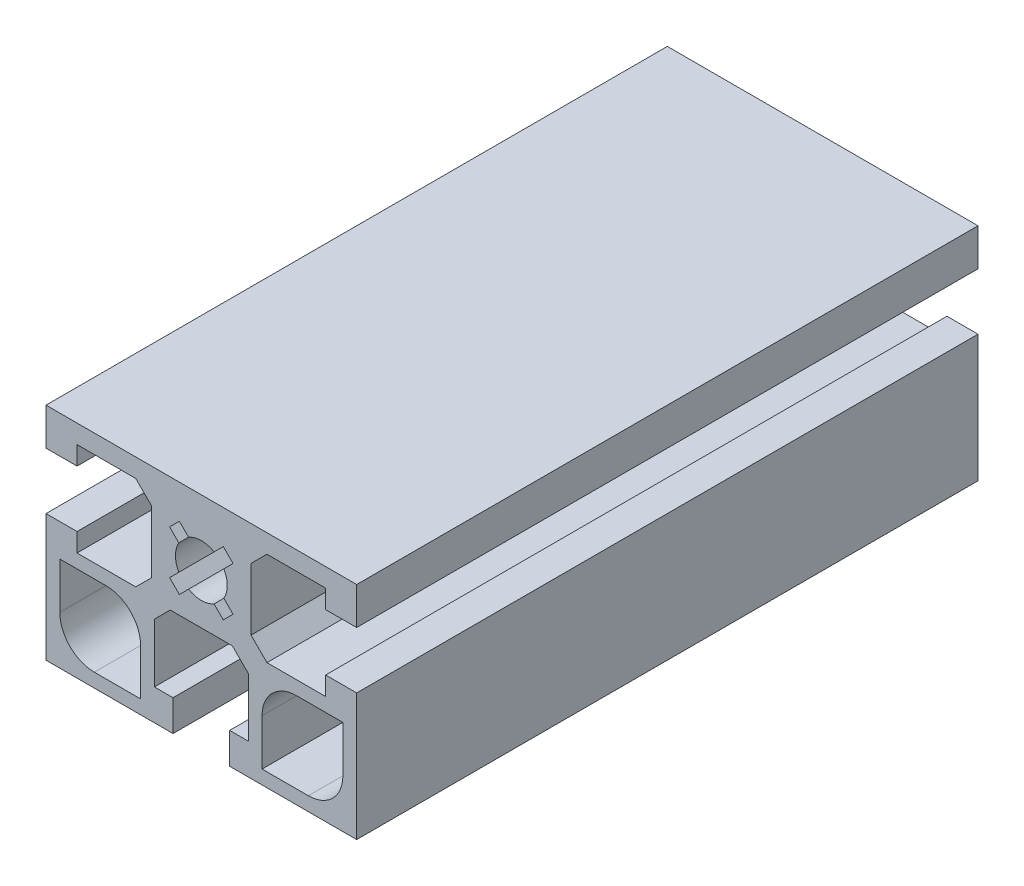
ISO-10303-21;
HEADER;
FILE_DESCRIPTION(('STEP AP214'),'2;1');
FILE_NAME('part.step','',(''),(''),'','','');
FILE_SCHEMA(('AUTOMOTIVE_DESIGN { 1 0 10303 214 1 1 1 1 }'));
ENDSEC;
DATA;
#1=APPLICATION_CONTEXT('core data for automotive mechanical design processes');
#2=APPLICATION_PROTOCOL_DEFINITION('international standard','automotive_design',2000,#1);
#3=PRODUCT_CONTEXT('',#1,'mechanical');
#4=PRODUCT('Part','Part','',(#3));
#5=PRODUCT_RELATED_PRODUCT_CATEGORY('part','',(#4));
#6=PRODUCT_DEFINITION_FORMATION('','',#4);
#7=PRODUCT_DEFINITION_CONTEXT('part definition',#1,'design');
#8=PRODUCT_DEFINITION('design','',#6,#7);
#9=PRODUCT_DEFINITION_SHAPE('','',#8);
#10=(LENGTH_UNIT() NAMED_UNIT(*) SI_UNIT(.MILLI.,.METRE.));
#11=(NAMED_UNIT(*) PLANE_ANGLE_UNIT() SI_UNIT($,.RADIAN.));
#12=(NAMED_UNIT(*) SI_UNIT($,.STERADIAN.) SOLID_ANGLE_UNIT());
#13=UNCERTAINTY_MEASURE_WITH_UNIT(LENGTH_MEASURE(1.E-05),#10,'distance_accuracy_value','');
#14=(GEOMETRIC_REPRESENTATION_CONTEXT(3) GLOBAL_UNCERTAINTY_ASSIGNED_CONTEXT((#13)) GLOBAL_UNIT_ASSIGNED_CONTEXT((#10,
#11,#12)) REPRESENTATION_CONTEXT('',''));
#15=CARTESIAN_POINT('',(0.,0.,0.));
#16=DIRECTION('',(0.,0.,1.));
#17=DIRECTION('',(1.,0.,0.));
#18=AXIS2_PLACEMENT_3D('',#15,#16,#17);
#19=CARTESIAN_POINT('',(-22.4999999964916,-4.09999999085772,-45.));
#20=DIRECTION('',(-1.,0.,0.));
#21=DIRECTION('',(0.,0.,1.));
#22=AXIS2_PLACEMENT_3D('',#19,#20,#21);
#23=PLANE('',#22);
#24=DIRECTION('',(0.,0.,1.));
#25=VECTOR('',#24,1.);
#26=CARTESIAN_POINT('',(-22.4999999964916,-22.4999999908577,-45.));
#27=LINE('',#26,#25);
#28=CARTESIAN_POINT('',(-22.4999999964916,-22.4999999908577,-45.));
#29=VERTEX_POINT('',#28);
#30=CARTESIAN_POINT('',(-22.4999999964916,-22.4999999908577,45.));
#31=VERTEX_POINT('',#30);
#32=EDGE_CURVE('E35',#29,#31,#27,.T.);
#33=ORIENTED_EDGE('',*,*,#32,.T.);
#34=DIRECTION('',(0.,-1.,0.));
#35=VECTOR('',#34,1.);
#36=CARTESIAN_POINT('',(-22.4999999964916,-4.09999999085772,45.));
#37=LINE('',#36,#35);
#38=CARTESIAN_POINT('',(-22.4999999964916,-4.09999999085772,45.));
#39=VERTEX_POINT('',#38);
#40=EDGE_CURVE('E524',#39,#31,#37,.T.);
#41=ORIENTED_EDGE('',*,*,#40,.F.);
#42=DIRECTION('',(0.,0.,1.));
#43=VECTOR('',#42,1.);
#44=CARTESIAN_POINT('',(-22.4999999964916,-4.09999999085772,-45.));
#45=LINE('',#44,#43);
#46=CARTESIAN_POINT('',(-22.4999999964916,-4.09999999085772,-45.));
#47=VERTEX_POINT('',#46);
#48=EDGE_CURVE('E11',#47,#39,#45,.T.);
#49=ORIENTED_EDGE('',*,*,#48,.F.);
#50=DIRECTION('',(0.,-1.,0.));
#51=VECTOR('',#50,1.);
#52=CARTESIAN_POINT('',(-22.4999999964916,-4.09999999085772,-45.));
#53=LINE('',#52,#51);
#54=EDGE_CURVE('E745',#47,#29,#53,.T.);
#55=ORIENTED_EDGE('',*,*,#54,.T.);
#56=EDGE_LOOP('',(#33,#41,#49,#55));
#57=FACE_BOUND('',#56,.T.);
#58=ADVANCED_FACE('F32',(#57),#23,.T.);
#59=CARTESIAN_POINT('',(-17.9999999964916,-4.09999999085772,-45.));
#60=DIRECTION('',(0.,1.,0.));
#61=DIRECTION('',(0.,0.,1.));
#62=AXIS2_PLACEMENT_3D('',#59,#60,#61);
#63=PLANE('',#62);
#64=ORIENTED_EDGE('',*,*,#48,.T.);
#65=DIRECTION('',(-1.,0.,0.));
#66=VECTOR('',#65,1.);
#67=CARTESIAN_POINT('',(-17.9999999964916,-4.09999999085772,45.));
#68=LINE('',#67,#66);
#69=CARTESIAN_POINT('',(-17.9999999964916,-4.09999999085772,45.));
#70=VERTEX_POINT('',#69);
#71=EDGE_CURVE('E623',#70,#39,#68,.T.);
#72=ORIENTED_EDGE('',*,*,#71,.F.);
#73=DIRECTION('',(0.,0.,1.));
#74=VECTOR('',#73,1.);
#75=CARTESIAN_POINT('',(-17.9999999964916,-4.09999999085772,-45.));
#76=LINE('',#75,#74);
#77=CARTESIAN_POINT('',(-17.9999999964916,-4.09999999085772,-45.));
#78=VERTEX_POINT('',#77);
#79=EDGE_CURVE('E40',#78,#70,#76,.T.);
#80=ORIENTED_EDGE('',*,*,#79,.F.);
#81=DIRECTION('',(-1.,0.,0.));
#82=VECTOR('',#81,1.);
#83=CARTESIAN_POINT('',(-17.9999999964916,-4.09999999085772,-45.));
#84=LINE('',#83,#82);
#85=EDGE_CURVE('E853',#78,#47,#84,.T.);
#86=ORIENTED_EDGE('',*,*,#85,.T.);
#87=EDGE_LOOP('',(#64,#72,#80,#86));
#88=FACE_BOUND('',#87,.T.);
#89=ADVANCED_FACE('F930',(#88),#63,.T.);
#90=CARTESIAN_POINT('',(-17.9999999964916,-6.79999999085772,-45.));
#91=DIRECTION('',(1.,0.,0.));
#92=DIRECTION('',(0.,0.,-1.));
#93=AXIS2_PLACEMENT_3D('',#90,#91,#92);
#94=PLANE('',#93);
#95=ORIENTED_EDGE('',*,*,#79,.T.);
#96=DIRECTION('',(0.,1.,0.));
#97=VECTOR('',#96,1.);
#98=CARTESIAN_POINT('',(-17.9999999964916,-6.79999999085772,45.));
#99=LINE('',#98,#97);
#100=CARTESIAN_POINT('',(-17.9999999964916,-6.79999999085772,45.));
#101=VERTEX_POINT('',#100);
#102=EDGE_CURVE('E620',#101,#70,#99,.T.);
#103=ORIENTED_EDGE('',*,*,#102,.F.);
#104=DIRECTION('',(0.,0.,1.));
#105=VECTOR('',#104,1.);
#106=CARTESIAN_POINT('',(-17.9999999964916,-6.79999999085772,-45.));
#107=LINE('',#106,#105);
#108=CARTESIAN_POINT('',(-17.9999999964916,-6.79999999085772,-45.));
#109=VERTEX_POINT('',#108);
#110=EDGE_CURVE('E857',#109,#101,#107,.T.);
#111=ORIENTED_EDGE('',*,*,#110,.F.);
#112=DIRECTION('',(0.,1.,0.));
#113=VECTOR('',#112,1.);
#114=CARTESIAN_POINT('',(-17.9999999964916,-6.79999999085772,-45.));
#115=LINE('',#114,#113);
#116=EDGE_CURVE('E850',#109,#78,#115,.T.);
#117=ORIENTED_EDGE('',*,*,#116,.T.);
#118=EDGE_LOOP('',(#95,#103,#111,#117));
#119=FACE_BOUND('',#118,.T.);
#120=ADVANCED_FACE('F1055',(#119),#94,.T.);
#121=CARTESIAN_POINT('',(-9.49999999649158,-6.79999999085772,-45.));
#122=DIRECTION('',(0.,1.,0.));
#123=DIRECTION('',(0.,0.,1.));
#124=AXIS2_PLACEMENT_3D('',#121,#122,#123);
#125=PLANE('',#124);
#126=ORIENTED_EDGE('',*,*,#110,.T.);
#127=DIRECTION('',(-1.,0.,0.));
#128=VECTOR('',#127,1.);
#129=CARTESIAN_POINT('',(-9.49999999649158,-6.79999999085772,45.));
#130=LINE('',#129,#128);
#131=CARTESIAN_POINT('',(-9.49999999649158,-6.79999999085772,45.));
#132=VERTEX_POINT('',#131);
#133=EDGE_CURVE('E617',#132,#101,#130,.T.);
#134=ORIENTED_EDGE('',*,*,#133,.F.);
#135=DIRECTION('',(0.,0.,1.));
#136=VECTOR('',#135,1.);
#137=CARTESIAN_POINT('',(-9.49999999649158,-6.79999999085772,-45.));
#138=LINE('',#137,#136);
#139=CARTESIAN_POINT('',(-9.49999999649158,-6.79999999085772,-45.));
#140=VERTEX_POINT('',#139);
#141=EDGE_CURVE('E859',#140,#132,#138,.T.);
#142=ORIENTED_EDGE('',*,*,#141,.F.);
#143=DIRECTION('',(-1.,0.,0.));
#144=VECTOR('',#143,1.);
#145=CARTESIAN_POINT('',(-9.49999999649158,-6.79999999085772,-45.));
#146=LINE('',#145,#144);
#147=EDGE_CURVE('E847',#140,#109,#146,.T.);
#148=ORIENTED_EDGE('',*,*,#147,.T.);
#149=EDGE_LOOP('',(#126,#134,#142,#148));
#150=FACE_BOUND('',#149,.T.);
#151=ADVANCED_FACE('F1053',(#150),#125,.T.);
#152=CARTESIAN_POINT('',(-7.19999999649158,-4.49999999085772,-45.));
#153=DIRECTION('',(-0.707106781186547,0.707106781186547,0.));
#154=DIRECTION('',(-0.707106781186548,-0.707106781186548,0.));
#155=AXIS2_PLACEMENT_3D('',#152,#153,#154);
#156=PLANE('',#155);
#157=ORIENTED_EDGE('',*,*,#141,.T.);
#158=DIRECTION('',(-0.707106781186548,-0.707106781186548,0.));
#159=VECTOR('',#158,1.);
#160=CARTESIAN_POINT('',(-7.19999999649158,-4.49999999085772,45.));
#161=LINE('',#160,#159);
#162=CARTESIAN_POINT('',(-7.19999999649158,-4.49999999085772,45.));
#163=VERTEX_POINT('',#162);
#164=EDGE_CURVE('E614',#163,#132,#161,.T.);
#165=ORIENTED_EDGE('',*,*,#164,.F.);
#166=DIRECTION('',(0.,0.,1.));
#167=VECTOR('',#166,1.);
#168=CARTESIAN_POINT('',(-7.19999999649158,-4.49999999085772,-45.));
#169=LINE('',#168,#167);
#170=CARTESIAN_POINT('',(-7.19999999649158,-4.49999999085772,-45.));
#171=VERTEX_POINT('',#170);
#172=EDGE_CURVE('E861',#171,#163,#169,.T.);
#173=ORIENTED_EDGE('',*,*,#172,.F.);
#174=DIRECTION('',(-0.707106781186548,-0.707106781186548,0.));
#175=VECTOR('',#174,1.);
#176=CARTESIAN_POINT('',(-7.19999999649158,-4.49999999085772,-45.));
#177=LINE('',#176,#175);
#178=EDGE_CURVE('E844',#171,#140,#177,.T.);
#179=ORIENTED_EDGE('',*,*,#178,.T.);
#180=EDGE_LOOP('',(#157,#165,#173,#179));
#181=FACE_BOUND('',#180,.T.);
#182=ADVANCED_FACE('F1051',(#181),#156,.T.);
#183=CARTESIAN_POINT('',(-7.19999999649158,4.50000000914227,-45.));
#184=DIRECTION('',(-1.,0.,0.));
#185=DIRECTION('',(0.,0.,1.));
#186=AXIS2_PLACEMENT_3D('',#183,#184,#185);
#187=PLANE('',#186);
#188=ORIENTED_EDGE('',*,*,#172,.T.);
#189=DIRECTION('',(0.,-1.,0.));
#190=VECTOR('',#189,1.);
#191=CARTESIAN_POINT('',(-7.19999999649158,4.50000000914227,45.));
#192=LINE('',#191,#190);
#193=CARTESIAN_POINT('',(-7.19999999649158,4.50000000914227,45.));
#194=VERTEX_POINT('',#193);
#195=EDGE_CURVE('E611',#194,#163,#192,.T.);
#196=ORIENTED_EDGE('',*,*,#195,.F.);
#197=DIRECTION('',(0.,0.,1.));
#198=VECTOR('',#197,1.);
#199=CARTESIAN_POINT('',(-7.19999999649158,4.50000000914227,-45.));
#200=LINE('',#199,#198);
#201=CARTESIAN_POINT('',(-7.19999999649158,4.50000000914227,-45.));
#202=VERTEX_POINT('',#201);
#203=EDGE_CURVE('E863',#202,#194,#200,.T.);
#204=ORIENTED_EDGE('',*,*,#203,.F.);
#205=DIRECTION('',(0.,-1.,0.));
#206=VECTOR('',#205,1.);
#207=CARTESIAN_POINT('',(-7.19999999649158,4.50000000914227,-45.));
#208=LINE('',#207,#206);
#209=EDGE_CURVE('E841',#202,#171,#208,.T.);
#210=ORIENTED_EDGE('',*,*,#209,.T.);
#211=EDGE_LOOP('',(#188,#196,#204,#210));
#212=FACE_BOUND('',#211,.T.);
#213=ADVANCED_FACE('F1046',(#212),#187,.T.);
#214=CARTESIAN_POINT('',(-9.4999999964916,6.80000000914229,-45.));
#215=DIRECTION('',(-0.707106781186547,-0.707106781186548,0.));
#216=DIRECTION('',(0.707106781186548,-0.707106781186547,0.));
#217=AXIS2_PLACEMENT_3D('',#214,#215,#216);
#218=PLANE('',#217);
#219=ORIENTED_EDGE('',*,*,#203,.T.);
#220=DIRECTION('',(0.707106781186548,-0.707106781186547,0.));
#221=VECTOR('',#220,1.);
#222=CARTESIAN_POINT('',(-9.4999999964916,6.80000000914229,45.));
#223=LINE('',#222,#221);
#224=CARTESIAN_POINT('',(-9.4999999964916,6.80000000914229,45.));
#225=VERTEX_POINT('',#224);
#226=EDGE_CURVE('E608',#225,#194,#223,.T.);
#227=ORIENTED_EDGE('',*,*,#226,.F.);
#228=DIRECTION('',(0.,0.,1.));
#229=VECTOR('',#228,1.);
#230=CARTESIAN_POINT('',(-9.4999999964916,6.80000000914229,-45.));
#231=LINE('',#230,#229);
#232=CARTESIAN_POINT('',(-9.4999999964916,6.80000000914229,-45.));
#233=VERTEX_POINT('',#232);
#234=EDGE_CURVE('E865',#233,#225,#231,.T.);
#235=ORIENTED_EDGE('',*,*,#234,.F.);
#236=DIRECTION('',(0.707106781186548,-0.707106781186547,0.));
#237=VECTOR('',#236,1.);
#238=CARTESIAN_POINT('',(-9.4999999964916,6.80000000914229,-45.));
#239=LINE('',#238,#237);
#240=EDGE_CURVE('E838',#233,#202,#239,.T.);
#241=ORIENTED_EDGE('',*,*,#240,.T.);
#242=EDGE_LOOP('',(#219,#227,#235,#241));
#243=FACE_BOUND('',#242,.T.);
#244=ADVANCED_FACE('F1041',(#243),#218,.T.);
#245=CARTESIAN_POINT('',(-17.9999999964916,6.80000000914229,-45.));
#246=DIRECTION('',(0.,-1.,0.));
#247=DIRECTION('',(0.,0.,-1.));
#248=AXIS2_PLACEMENT_3D('',#245,#246,#247);
#249=PLANE('',#248);
#250=ORIENTED_EDGE('',*,*,#234,.T.);
#251=DIRECTION('',(1.,0.,0.));
#252=VECTOR('',#251,1.);
#253=CARTESIAN_POINT('',(-17.9999999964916,6.80000000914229,45.));
#254=LINE('',#253,#252);
#255=CARTESIAN_POINT('',(-17.9999999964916,6.80000000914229,45.));
#256=VERTEX_POINT('',#255);
#257=EDGE_CURVE('E605',#256,#225,#254,.T.);
#258=ORIENTED_EDGE('',*,*,#257,.F.);
#259=DIRECTION('',(0.,0.,1.));
#260=VECTOR('',#259,1.);
#261=CARTESIAN_POINT('',(-17.9999999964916,6.80000000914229,-45.));
#262=LINE('',#261,#260);
#263=CARTESIAN_POINT('',(-17.9999999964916,6.80000000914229,-45.));
#264=VERTEX_POINT('',#263);
#265=EDGE_CURVE('E867',#264,#256,#262,.T.);
#266=ORIENTED_EDGE('',*,*,#265,.F.);
#267=DIRECTION('',(1.,0.,0.));
#268=VECTOR('',#267,1.);
#269=CARTESIAN_POINT('',(-17.9999999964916,6.80000000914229,-45.));
#270=LINE('',#269,#268);
#271=EDGE_CURVE('E835',#264,#233,#270,.T.);
#272=ORIENTED_EDGE('',*,*,#271,.T.);
#273=EDGE_LOOP('',(#250,#258,#266,#272));
#274=FACE_BOUND('',#273,.T.);
#275=ADVANCED_FACE('F1039',(#274),#249,.T.);
#276=CARTESIAN_POINT('',(-17.9999999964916,4.10000000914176,-45.));
#277=DIRECTION('',(1.,0.,0.));
#278=DIRECTION('',(0.,0.,-1.));
#279=AXIS2_PLACEMENT_3D('',#276,#277,#278);
#280=PLANE('',#279);
#281=ORIENTED_EDGE('',*,*,#265,.T.);
#282=DIRECTION('',(0.,1.,0.));
#283=VECTOR('',#282,1.);
#284=CARTESIAN_POINT('',(-17.9999999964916,4.10000000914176,45.));
#285=LINE('',#284,#283);
#286=CARTESIAN_POINT('',(-17.9999999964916,4.10000000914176,45.));
#287=VERTEX_POINT('',#286);
#288=EDGE_CURVE('E602',#287,#256,#285,.T.);
#289=ORIENTED_EDGE('',*,*,#288,.F.);
#290=DIRECTION('',(0.,0.,1.));
#291=VECTOR('',#290,1.);
#292=CARTESIAN_POINT('',(-17.9999999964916,4.10000000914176,-45.));
#293=LINE('',#292,#291);
#294=CARTESIAN_POINT('',(-17.9999999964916,4.10000000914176,-45.));
#295=VERTEX_POINT('',#294);
#296=EDGE_CURVE('E869',#295,#287,#293,.T.);
#297=ORIENTED_EDGE('',*,*,#296,.F.);
#298=DIRECTION('',(0.,1.,0.));
#299=VECTOR('',#298,1.);
#300=CARTESIAN_POINT('',(-17.9999999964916,4.10000000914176,-45.));
#301=LINE('',#300,#299);
#302=EDGE_CURVE('E832',#295,#264,#301,.T.);
#303=ORIENTED_EDGE('',*,*,#302,.T.);
#304=EDGE_LOOP('',(#281,#289,#297,#303));
#305=FACE_BOUND('',#304,.T.);
#306=ADVANCED_FACE('F1034',(#305),#280,.T.);
#307=CARTESIAN_POINT('',(-22.4999999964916,4.10000000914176,-45.));
#308=DIRECTION('',(0.,-1.,0.));
#309=DIRECTION('',(0.,0.,-1.));
#310=AXIS2_PLACEMENT_3D('',#307,#308,#309);
#311=PLANE('',#310);
#312=ORIENTED_EDGE('',*,*,#296,.T.);
#313=DIRECTION('',(1.,0.,0.));
#314=VECTOR('',#313,1.);
#315=CARTESIAN_POINT('',(-22.4999999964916,4.10000000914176,45.));
#316=LINE('',#315,#314);
#317=CARTESIAN_POINT('',(-22.4999999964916,4.10000000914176,45.));
#318=VERTEX_POINT('',#317);
#319=EDGE_CURVE('E599',#318,#287,#316,.T.);
#320=ORIENTED_EDGE('',*,*,#319,.F.);
#321=DIRECTION('',(0.,0.,1.));
#322=VECTOR('',#321,1.);
#323=CARTESIAN_POINT('',(-22.4999999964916,4.10000000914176,-45.));
#324=LINE('',#323,#322);
#325=CARTESIAN_POINT('',(-22.4999999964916,4.10000000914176,-45.));
#326=VERTEX_POINT('',#325);
#327=EDGE_CURVE('E871',#326,#318,#324,.T.);
#328=ORIENTED_EDGE('',*,*,#327,.F.);
#329=DIRECTION('',(1.,0.,0.));
#330=VECTOR('',#329,1.);
#331=CARTESIAN_POINT('',(-22.4999999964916,4.10000000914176,-45.));
#332=LINE('',#331,#330);
#333=EDGE_CURVE('E829',#326,#295,#332,.T.);
#334=ORIENTED_EDGE('',*,*,#333,.T.);
#335=EDGE_LOOP('',(#312,#320,#328,#334));
#336=FACE_BOUND('',#335,.T.);
#337=ADVANCED_FACE('F1029',(#336),#311,.T.);
#338=CARTESIAN_POINT('',(-22.4999999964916,9.49999999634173,-45.));
#339=DIRECTION('',(-1.,0.,0.));
#340=DIRECTION('',(0.,0.,1.));
#341=AXIS2_PLACEMENT_3D('',#338,#339,#340);
#342=PLANE('',#341);
#343=ORIENTED_EDGE('',*,*,#327,.T.);
#344=DIRECTION('',(0.,-1.,0.));
#345=VECTOR('',#344,1.);
#346=CARTESIAN_POINT('',(-22.4999999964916,9.49999999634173,45.));
#347=LINE('',#346,#345);
#348=CARTESIAN_POINT('',(-22.4999999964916,9.49999999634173,45.));
#349=VERTEX_POINT('',#348);
#350=EDGE_CURVE('E596',#349,#318,#347,.T.);
#351=ORIENTED_EDGE('',*,*,#350,.F.);
#352=DIRECTION('',(0.,0.,1.));
#353=VECTOR('',#352,1.);
#354=CARTESIAN_POINT('',(-22.4999999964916,9.49999999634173,-45.));
#355=LINE('',#354,#353);
#356=CARTESIAN_POINT('',(-22.4999999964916,9.49999999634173,-45.));
#357=VERTEX_POINT('',#356);
#358=EDGE_CURVE('E873',#357,#349,#355,.T.);
#359=ORIENTED_EDGE('',*,*,#358,.F.);
#360=DIRECTION('',(0.,-1.,0.));
#361=VECTOR('',#360,1.);
#362=CARTESIAN_POINT('',(-22.4999999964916,9.49999999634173,-45.));
#363=LINE('',#362,#361);
#364=EDGE_CURVE('E826',#357,#326,#363,.T.);
#365=ORIENTED_EDGE('',*,*,#364,.T.);
#366=EDGE_LOOP('',(#343,#351,#359,#365));
#367=FACE_BOUND('',#366,.T.);
#368=ADVANCED_FACE('F1027',(#367),#342,.T.);
#369=CARTESIAN_POINT('',(22.4999999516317,9.49999999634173,-45.));
#370=DIRECTION('',(0.,1.,0.));
#371=DIRECTION('',(0.,0.,1.));
#372=AXIS2_PLACEMENT_3D('',#369,#370,#371);
#373=PLANE('',#372);
#374=ORIENTED_EDGE('',*,*,#358,.T.);
#375=DIRECTION('',(-1.,0.,0.));
#376=VECTOR('',#375,1.);
#377=CARTESIAN_POINT('',(22.4999999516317,9.49999999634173,45.));
#378=LINE('',#377,#376);
#379=CARTESIAN_POINT('',(22.4999999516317,9.49999999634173,45.));
#380=VERTEX_POINT('',#379);
#381=EDGE_CURVE('E593',#380,#349,#378,.T.);
#382=ORIENTED_EDGE('',*,*,#381,.F.);
#383=DIRECTION('',(0.,0.,1.));
#384=VECTOR('',#383,1.);
#385=CARTESIAN_POINT('',(22.4999999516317,9.49999999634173,-45.));
#386=LINE('',#385,#384);
#387=CARTESIAN_POINT('',(22.4999999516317,9.49999999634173,-45.));
#388=VERTEX_POINT('',#387);
#389=EDGE_CURVE('E875',#388,#380,#386,.T.);
#390=ORIENTED_EDGE('',*,*,#389,.F.);
#391=DIRECTION('',(-1.,0.,0.));
#392=VECTOR('',#391,1.);
#393=CARTESIAN_POINT('',(22.4999999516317,9.49999999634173,-45.));
#394=LINE('',#393,#392);
#395=EDGE_CURVE('E823',#388,#357,#394,.T.);
#396=ORIENTED_EDGE('',*,*,#395,.T.);
#397=EDGE_LOOP('',(#374,#382,#390,#396));
#398=FACE_BOUND('',#397,.T.);
#399=ADVANCED_FACE('F1022',(#398),#373,.T.);
#400=CARTESIAN_POINT('',(22.4999999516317,4.10000000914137,-45.));
#401=DIRECTION('',(1.,0.,0.));
#402=DIRECTION('',(0.,0.,-1.));
#403=AXIS2_PLACEMENT_3D('',#400,#401,#402);
#404=PLANE('',#403);
#405=ORIENTED_EDGE('',*,*,#389,.T.);
#406=DIRECTION('',(0.,1.,0.));
#407=VECTOR('',#406,1.);
#408=CARTESIAN_POINT('',(22.4999999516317,4.10000000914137,45.));
#409=LINE('',#408,#407);
#410=CARTESIAN_POINT('',(22.4999999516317,4.10000000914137,45.));
#411=VERTEX_POINT('',#410);
#412=EDGE_CURVE('E590',#411,#380,#409,.T.);
#413=ORIENTED_EDGE('',*,*,#412,.F.);
#414=DIRECTION('',(0.,0.,1.));
#415=VECTOR('',#414,1.);
#416=CARTESIAN_POINT('',(22.4999999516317,4.10000000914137,-45.));
#417=LINE('',#416,#415);
#418=CARTESIAN_POINT('',(22.4999999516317,4.10000000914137,-45.));
#419=VERTEX_POINT('',#418);
#420=EDGE_CURVE('E877',#419,#411,#417,.T.);
#421=ORIENTED_EDGE('',*,*,#420,.F.);
#422=DIRECTION('',(0.,1.,0.));
#423=VECTOR('',#422,1.);
#424=CARTESIAN_POINT('',(22.4999999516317,4.10000000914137,-45.));
#425=LINE('',#424,#423);
#426=EDGE_CURVE('E820',#419,#388,#425,.T.);
#427=ORIENTED_EDGE('',*,*,#426,.T.);
#428=EDGE_LOOP('',(#405,#413,#421,#427));
#429=FACE_BOUND('',#428,.T.);
#430=ADVANCED_FACE('F1017',(#429),#404,.T.);
#431=CARTESIAN_POINT('',(17.9999999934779,4.10000000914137,-45.));
#432=DIRECTION('',(0.,-1.,0.));
#433=DIRECTION('',(0.,0.,-1.));
#434=AXIS2_PLACEMENT_3D('',#431,#432,#433);
#435=PLANE('',#434);
#436=ORIENTED_EDGE('',*,*,#420,.T.);
#437=DIRECTION('',(1.,0.,0.));
#438=VECTOR('',#437,1.);
#439=CARTESIAN_POINT('',(17.9999999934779,4.10000000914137,45.));
#440=LINE('',#439,#438);
#441=CARTESIAN_POINT('',(17.9999999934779,4.10000000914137,45.));
#442=VERTEX_POINT('',#441);
#443=EDGE_CURVE('E587',#442,#411,#440,.T.);
#444=ORIENTED_EDGE('',*,*,#443,.F.);
#445=DIRECTION('',(0.,0.,1.));
#446=VECTOR('',#445,1.);
#447=CARTESIAN_POINT('',(17.9999999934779,4.10000000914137,-45.));
#448=LINE('',#447,#446);
#449=CARTESIAN_POINT('',(17.9999999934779,4.10000000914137,-45.));
#450=VERTEX_POINT('',#449);
#451=EDGE_CURVE('E879',#450,#442,#448,.T.);
#452=ORIENTED_EDGE('',*,*,#451,.F.);
#453=DIRECTION('',(1.,0.,0.));
#454=VECTOR('',#453,1.);
#455=CARTESIAN_POINT('',(17.9999999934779,4.10000000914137,-45.));
#456=LINE('',#455,#454);
#457=EDGE_CURVE('E817',#450,#419,#456,.T.);
#458=ORIENTED_EDGE('',*,*,#457,.T.);
#459=EDGE_LOOP('',(#436,#444,#452,#458));
#460=FACE_BOUND('',#459,.T.);
#461=ADVANCED_FACE('F1015',(#460),#435,.T.);
#462=CARTESIAN_POINT('',(17.9999999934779,6.80000000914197,-45.));
#463=DIRECTION('',(-1.,0.,0.));
#464=DIRECTION('',(0.,0.,1.));
#465=AXIS2_PLACEMENT_3D('',#462,#463,#464);
#466=PLANE('',#465);
#467=ORIENTED_EDGE('',*,*,#451,.T.);
#468=DIRECTION('',(0.,-1.,0.));
#469=VECTOR('',#468,1.);
#470=CARTESIAN_POINT('',(17.9999999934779,6.80000000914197,45.));
#471=LINE('',#470,#469);
#472=CARTESIAN_POINT('',(17.9999999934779,6.80000000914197,45.));
#473=VERTEX_POINT('',#472);
#474=EDGE_CURVE('E584',#473,#442,#471,.T.);
#475=ORIENTED_EDGE('',*,*,#474,.F.);
#476=DIRECTION('',(0.,0.,1.));
#477=VECTOR('',#476,1.);
#478=CARTESIAN_POINT('',(17.9999999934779,6.80000000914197,-45.));
#479=LINE('',#478,#477);
#480=CARTESIAN_POINT('',(17.9999999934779,6.80000000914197,-45.));
#481=VERTEX_POINT('',#480);
#482=EDGE_CURVE('E881',#481,#473,#479,.T.);
#483=ORIENTED_EDGE('',*,*,#482,.F.);
#484=DIRECTION('',(0.,-1.,0.));
#485=VECTOR('',#484,1.);
#486=CARTESIAN_POINT('',(17.9999999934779,6.80000000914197,-45.));
#487=LINE('',#486,#485);
#488=EDGE_CURVE('E814',#481,#450,#487,.T.);
#489=ORIENTED_EDGE('',*,*,#488,.T.);
#490=EDGE_LOOP('',(#467,#475,#483,#489));
#491=FACE_BOUND('',#490,.T.);
#492=ADVANCED_FACE('F1010',(#491),#466,.T.);
#493=CARTESIAN_POINT('',(9.49999999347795,6.80000000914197,-45.));
#494=DIRECTION('',(0.,-1.,0.));
#495=DIRECTION('',(0.,0.,-1.));
#496=AXIS2_PLACEMENT_3D('',#493,#494,#495);
#497=PLANE('',#496);
#498=ORIENTED_EDGE('',*,*,#482,.T.);
#499=DIRECTION('',(1.,0.,0.));
#500=VECTOR('',#499,1.);
#501=CARTESIAN_POINT('',(9.49999999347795,6.80000000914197,45.));
#502=LINE('',#501,#500);
#503=CARTESIAN_POINT('',(9.49999999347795,6.80000000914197,45.));
#504=VERTEX_POINT('',#503);
#505=EDGE_CURVE('E581',#504,#473,#502,.T.);
#506=ORIENTED_EDGE('',*,*,#505,.F.);
#507=DIRECTION('',(0.,0.,1.));
#508=VECTOR('',#507,1.);
#509=CARTESIAN_POINT('',(9.49999999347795,6.80000000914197,-45.));
#510=LINE('',#509,#508);
#511=CARTESIAN_POINT('',(9.49999999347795,6.80000000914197,-45.));
#512=VERTEX_POINT('',#511);
#513=EDGE_CURVE('E883',#512,#504,#510,.T.);
#514=ORIENTED_EDGE('',*,*,#513,.F.);
#515=DIRECTION('',(1.,0.,0.));
#516=VECTOR('',#515,1.);
#517=CARTESIAN_POINT('',(9.49999999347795,6.80000000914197,-45.));
#518=LINE('',#517,#516);
#519=EDGE_CURVE('E811',#512,#481,#518,.T.);
#520=ORIENTED_EDGE('',*,*,#519,.T.);
#521=EDGE_LOOP('',(#498,#506,#514,#520));
#522=FACE_BOUND('',#521,.T.);
#523=ADVANCED_FACE('F1005',(#522),#497,.T.);
#524=CARTESIAN_POINT('',(7.19999999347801,4.50000000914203,-45.));
#525=DIRECTION('',(0.707106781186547,-0.707106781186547,0.));
#526=DIRECTION('',(0.707106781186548,0.707106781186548,0.));
#527=AXIS2_PLACEMENT_3D('',#524,#525,#526);
#528=PLANE('',#527);
#529=ORIENTED_EDGE('',*,*,#513,.T.);
#530=DIRECTION('',(0.707106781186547,0.707106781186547,0.));
#531=VECTOR('',#530,1.);
#532=CARTESIAN_POINT('',(7.19999999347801,4.50000000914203,45.));
#533=LINE('',#532,#531);
#534=CARTESIAN_POINT('',(7.19999999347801,4.50000000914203,45.));
#535=VERTEX_POINT('',#534);
#536=EDGE_CURVE('E578',#535,#504,#533,.T.);
#537=ORIENTED_EDGE('',*,*,#536,.F.);
#538=DIRECTION('',(0.,0.,1.));
#539=VECTOR('',#538,1.);
#540=CARTESIAN_POINT('',(7.19999999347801,4.50000000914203,-45.));
#541=LINE('',#540,#539);
#542=CARTESIAN_POINT('',(7.19999999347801,4.50000000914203,-45.));
#543=VERTEX_POINT('',#542);
#544=EDGE_CURVE('E885',#543,#535,#541,.T.);
#545=ORIENTED_EDGE('',*,*,#544,.F.);
#546=DIRECTION('',(0.707106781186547,0.707106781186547,0.));
#547=VECTOR('',#546,1.);
#548=CARTESIAN_POINT('',(7.19999999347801,4.50000000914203,-45.));
#549=LINE('',#548,#547);
#550=EDGE_CURVE('E808',#543,#512,#549,.T.);
#551=ORIENTED_EDGE('',*,*,#550,.T.);
#552=EDGE_LOOP('',(#529,#537,#545,#551));
#553=FACE_BOUND('',#552,.T.);
#554=ADVANCED_FACE('F1003',(#553),#528,.T.);
#555=CARTESIAN_POINT('',(7.19999999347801,-4.49999999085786,-45.));
#556=DIRECTION('',(1.,0.,0.));
#557=DIRECTION('',(0.,0.,-1.));
#558=AXIS2_PLACEMENT_3D('',#555,#556,#557);
#559=PLANE('',#558);
#560=ORIENTED_EDGE('',*,*,#544,.T.);
#561=DIRECTION('',(0.,1.,0.));
#562=VECTOR('',#561,1.);
#563=CARTESIAN_POINT('',(7.19999999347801,-4.49999999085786,45.));
#564=LINE('',#563,#562);
#565=CARTESIAN_POINT('',(7.19999999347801,-4.49999999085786,45.));
#566=VERTEX_POINT('',#565);
#567=EDGE_CURVE('E575',#566,#535,#564,.T.);
#568=ORIENTED_EDGE('',*,*,#567,.F.);
#569=DIRECTION('',(0.,0.,1.));
#570=VECTOR('',#569,1.);
#571=CARTESIAN_POINT('',(7.19999999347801,-4.49999999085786,-45.));
#572=LINE('',#571,#570);
#573=CARTESIAN_POINT('',(7.19999999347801,-4.49999999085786,-45.));
#574=VERTEX_POINT('',#573);
#575=EDGE_CURVE('E887',#574,#566,#572,.T.);
#576=ORIENTED_EDGE('',*,*,#575,.F.);
#577=DIRECTION('',(0.,1.,0.));
#578=VECTOR('',#577,1.);
#579=CARTESIAN_POINT('',(7.19999999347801,-4.49999999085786,-45.));
#580=LINE('',#579,#578);
#581=EDGE_CURVE('E805',#574,#543,#580,.T.);
#582=ORIENTED_EDGE('',*,*,#581,.T.);
#583=EDGE_LOOP('',(#560,#568,#576,#582));
#584=FACE_BOUND('',#583,.T.);
#585=ADVANCED_FACE('F998',(#584),#559,.T.);
#586=CARTESIAN_POINT('',(9.4999999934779,-6.79999999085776,-45.));
#587=DIRECTION('',(0.707106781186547,0.707106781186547,0.));
#588=DIRECTION('',(-0.707106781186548,0.707106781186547,0.));
#589=AXIS2_PLACEMENT_3D('',#586,#587,#588);
#590=PLANE('',#589);
#591=ORIENTED_EDGE('',*,*,#575,.T.);
#592=DIRECTION('',(-0.707106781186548,0.707106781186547,0.));
#593=VECTOR('',#592,1.);
#594=CARTESIAN_POINT('',(9.4999999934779,-6.79999999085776,45.));
#595=LINE('',#594,#593);
#596=CARTESIAN_POINT('',(9.4999999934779,-6.79999999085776,45.));
#597=VERTEX_POINT('',#596);
#598=EDGE_CURVE('E572',#597,#566,#595,.T.);
#599=ORIENTED_EDGE('',*,*,#598,.F.);
#600=DIRECTION('',(0.,0.,1.));
#601=VECTOR('',#600,1.);
#602=CARTESIAN_POINT('',(9.4999999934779,-6.79999999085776,-45.));
#603=LINE('',#602,#601);
#604=CARTESIAN_POINT('',(9.4999999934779,-6.79999999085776,-45.));
#605=VERTEX_POINT('',#604);
#606=EDGE_CURVE('E889',#605,#597,#603,.T.);
#607=ORIENTED_EDGE('',*,*,#606,.F.);
#608=DIRECTION('',(-0.707106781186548,0.707106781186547,0.));
#609=VECTOR('',#608,1.);
#610=CARTESIAN_POINT('',(9.4999999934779,-6.79999999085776,-45.));
#611=LINE('',#610,#609);
#612=EDGE_CURVE('E802',#605,#574,#611,.T.);
#613=ORIENTED_EDGE('',*,*,#612,.T.);
#614=EDGE_LOOP('',(#591,#599,#607,#613));
#615=FACE_BOUND('',#614,.T.);
#616=ADVANCED_FACE('F993',(#615),#590,.T.);
#617=CARTESIAN_POINT('',(17.9999999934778,-6.79999999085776,-45.));
#618=DIRECTION('',(0.,1.,0.));
#619=DIRECTION('',(0.,0.,1.));
#620=AXIS2_PLACEMENT_3D('',#617,#618,#619);
#621=PLANE('',#620);
#622=ORIENTED_EDGE('',*,*,#606,.T.);
#623=DIRECTION('',(-1.,0.,0.));
#624=VECTOR('',#623,1.);
#625=CARTESIAN_POINT('',(17.9999999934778,-6.79999999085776,45.));
#626=LINE('',#625,#624);
#627=CARTESIAN_POINT('',(17.9999999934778,-6.79999999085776,45.));
#628=VERTEX_POINT('',#627);
#629=EDGE_CURVE('E569',#628,#597,#626,.T.);
#630=ORIENTED_EDGE('',*,*,#629,.F.);
#631=DIRECTION('',(0.,0.,1.));
#632=VECTOR('',#631,1.);
#633=CARTESIAN_POINT('',(17.9999999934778,-6.79999999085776,-45.));
#634=LINE('',#633,#632);
#635=CARTESIAN_POINT('',(17.9999999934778,-6.79999999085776,-45.));
#636=VERTEX_POINT('',#635);
#637=EDGE_CURVE('E891',#636,#628,#634,.T.);
#638=ORIENTED_EDGE('',*,*,#637,.F.);
#639=DIRECTION('',(-1.,0.,0.));
#640=VECTOR('',#639,1.);
#641=CARTESIAN_POINT('',(17.9999999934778,-6.79999999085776,-45.));
#642=LINE('',#641,#640);
#643=EDGE_CURVE('E799',#636,#605,#642,.T.);
#644=ORIENTED_EDGE('',*,*,#643,.T.);
#645=EDGE_LOOP('',(#622,#630,#638,#644));
#646=FACE_BOUND('',#645,.T.);
#647=ADVANCED_FACE('F991',(#646),#621,.T.);
#648=CARTESIAN_POINT('',(17.9999999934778,-4.09999999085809,-45.));
#649=DIRECTION('',(-1.,0.,0.));
#650=DIRECTION('',(0.,0.,1.));
#651=AXIS2_PLACEMENT_3D('',#648,#649,#650);
#652=PLANE('',#651);
#653=ORIENTED_EDGE('',*,*,#637,.T.);
#654=DIRECTION('',(0.,-1.,0.));
#655=VECTOR('',#654,1.);
#656=CARTESIAN_POINT('',(17.9999999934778,-4.09999999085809,45.));
#657=LINE('',#656,#655);
#658=CARTESIAN_POINT('',(17.9999999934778,-4.09999999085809,45.));
#659=VERTEX_POINT('',#658);
#660=EDGE_CURVE('E566',#659,#628,#657,.T.);
#661=ORIENTED_EDGE('',*,*,#660,.F.);
#662=DIRECTION('',(0.,0.,1.));
#663=VECTOR('',#662,1.);
#664=CARTESIAN_POINT('',(17.9999999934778,-4.09999999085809,-45.));
#665=LINE('',#664,#663);
#666=CARTESIAN_POINT('',(17.9999999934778,-4.09999999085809,-45.));
#667=VERTEX_POINT('',#666);
#668=EDGE_CURVE('E893',#667,#659,#665,.T.);
#669=ORIENTED_EDGE('',*,*,#668,.F.);
#670=DIRECTION('',(0.,-1.,0.));
#671=VECTOR('',#670,1.);
#672=CARTESIAN_POINT('',(17.9999999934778,-4.09999999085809,-45.));
#673=LINE('',#672,#671);
#674=EDGE_CURVE('E796',#667,#636,#673,.T.);
#675=ORIENTED_EDGE('',*,*,#674,.T.);
#676=EDGE_LOOP('',(#653,#661,#669,#675));
#677=FACE_BOUND('',#676,.T.);
#678=ADVANCED_FACE('F986',(#677),#652,.T.);
#679=CARTESIAN_POINT('',(22.4999999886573,-4.09999999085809,-45.));
#680=DIRECTION('',(0.,1.,0.));
#681=DIRECTION('',(0.,0.,1.));
#682=AXIS2_PLACEMENT_3D('',#679,#680,#681);
#683=PLANE('',#682);
#684=ORIENTED_EDGE('',*,*,#668,.T.);
#685=DIRECTION('',(-1.,0.,0.));
#686=VECTOR('',#685,1.);
#687=CARTESIAN_POINT('',(22.4999999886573,-4.09999999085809,45.));
#688=LINE('',#687,#686);
#689=CARTESIAN_POINT('',(22.4999999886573,-4.09999999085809,45.));
#690=VERTEX_POINT('',#689);
#691=EDGE_CURVE('E563',#690,#659,#688,.T.);
#692=ORIENTED_EDGE('',*,*,#691,.F.);
#693=DIRECTION('',(0.,0.,1.));
#694=VECTOR('',#693,1.);
#695=CARTESIAN_POINT('',(22.4999999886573,-4.09999999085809,-45.));
#696=LINE('',#695,#694);
#697=CARTESIAN_POINT('',(22.4999999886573,-4.09999999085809,-45.));
#698=VERTEX_POINT('',#697);
#699=EDGE_CURVE('E895',#698,#690,#696,.T.);
#700=ORIENTED_EDGE('',*,*,#699,.F.);
#701=DIRECTION('',(-1.,0.,0.));
#702=VECTOR('',#701,1.);
#703=CARTESIAN_POINT('',(22.4999999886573,-4.09999999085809,-45.));
#704=LINE('',#703,#702);
#705=EDGE_CURVE('E793',#698,#667,#704,.T.);
#706=ORIENTED_EDGE('',*,*,#705,.T.);
#707=EDGE_LOOP('',(#684,#692,#700,#706));
#708=FACE_BOUND('',#707,.T.);
#709=ADVANCED_FACE('F981',(#708),#683,.T.);
#710=CARTESIAN_POINT('',(22.4999999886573,-22.4999999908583,-45.));
#711=DIRECTION('',(1.,0.,0.));
#712=DIRECTION('',(0.,0.,-1.));
#713=AXIS2_PLACEMENT_3D('',#710,#711,#712);
#714=PLANE('',#713);
#715=ORIENTED_EDGE('',*,*,#699,.T.);
#716=DIRECTION('',(0.,1.,0.));
#717=VECTOR('',#716,1.);
#718=CARTESIAN_POINT('',(22.4999999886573,-22.4999999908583,45.));
#719=LINE('',#718,#717);
#720=CARTESIAN_POINT('',(22.4999999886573,-22.4999999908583,45.));
#721=VERTEX_POINT('',#720);
#722=EDGE_CURVE('E560',#721,#690,#719,.T.);
#723=ORIENTED_EDGE('',*,*,#722,.F.);
#724=DIRECTION('',(0.,0.,1.));
#725=VECTOR('',#724,1.);
#726=CARTESIAN_POINT('',(22.4999999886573,-22.4999999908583,-45.));
#727=LINE('',#726,#725);
#728=CARTESIAN_POINT('',(22.4999999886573,-22.4999999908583,-45.));
#729=VERTEX_POINT('',#728);
#730=EDGE_CURVE('E897',#729,#721,#727,.T.);
#731=ORIENTED_EDGE('',*,*,#730,.F.);
#732=DIRECTION('',(0.,1.,0.));
#733=VECTOR('',#732,1.);
#734=CARTESIAN_POINT('',(22.4999999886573,-22.4999999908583,-45.));
#735=LINE('',#734,#733);
#736=EDGE_CURVE('E790',#729,#698,#735,.T.);
#737=ORIENTED_EDGE('',*,*,#736,.T.);
#738=EDGE_LOOP('',(#715,#723,#731,#737));
#739=FACE_BOUND('',#738,.T.);
#740=ADVANCED_FACE('F979',(#739),#714,.T.);
#741=CARTESIAN_POINT('',(4.10000000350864,-22.4999999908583,-45.));
#742=DIRECTION('',(0.,-1.,0.));
#743=DIRECTION('',(0.,0.,-1.));
#744=AXIS2_PLACEMENT_3D('',#741,#742,#743);
#745=PLANE('',#744);
#746=ORIENTED_EDGE('',*,*,#730,.T.);
#747=DIRECTION('',(1.,0.,0.));
#748=VECTOR('',#747,1.);
#749=CARTESIAN_POINT('',(4.10000000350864,-22.4999999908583,45.));
#750=LINE('',#749,#748);
#751=CARTESIAN_POINT('',(4.10000000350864,-22.4999999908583,45.));
#752=VERTEX_POINT('',#751);
#753=EDGE_CURVE('E557',#752,#721,#750,.T.);
#754=ORIENTED_EDGE('',*,*,#753,.F.);
#755=DIRECTION('',(0.,0.,1.));
#756=VECTOR('',#755,1.);
#757=CARTESIAN_POINT('',(4.10000000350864,-22.4999999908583,-45.));
#758=LINE('',#757,#756);
#759=CARTESIAN_POINT('',(4.10000000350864,-22.4999999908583,-45.));
#760=VERTEX_POINT('',#759);
#761=EDGE_CURVE('E899',#760,#752,#758,.T.);
#762=ORIENTED_EDGE('',*,*,#761,.F.);
#763=DIRECTION('',(1.,0.,0.));
#764=VECTOR('',#763,1.);
#765=CARTESIAN_POINT('',(4.10000000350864,-22.4999999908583,-45.));
#766=LINE('',#765,#764);
#767=EDGE_CURVE('E787',#760,#729,#766,.T.);
#768=ORIENTED_EDGE('',*,*,#767,.T.);
#769=EDGE_LOOP('',(#746,#754,#762,#768));
#770=FACE_BOUND('',#769,.T.);
#771=ADVANCED_FACE('F974',(#770),#745,.T.);
#772=CARTESIAN_POINT('',(4.10000000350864,-17.9999999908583,-45.));
#773=DIRECTION('',(-1.,0.,0.));
#774=DIRECTION('',(0.,0.,1.));
#775=AXIS2_PLACEMENT_3D('',#772,#773,#774);
#776=PLANE('',#775);
#777=ORIENTED_EDGE('',*,*,#761,.T.);
#778=DIRECTION('',(0.,-1.,0.));
#779=VECTOR('',#778,1.);
#780=CARTESIAN_POINT('',(4.10000000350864,-17.9999999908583,45.));
#781=LINE('',#780,#779);
#782=CARTESIAN_POINT('',(4.10000000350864,-17.9999999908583,45.));
#783=VERTEX_POINT('',#782);
#784=EDGE_CURVE('E554',#783,#752,#781,.T.);
#785=ORIENTED_EDGE('',*,*,#784,.F.);
#786=DIRECTION('',(0.,0.,1.));
#787=VECTOR('',#786,1.);
#788=CARTESIAN_POINT('',(4.10000000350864,-17.9999999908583,-45.));
#789=LINE('',#788,#787);
#790=CARTESIAN_POINT('',(4.10000000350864,-17.9999999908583,-45.));
#791=VERTEX_POINT('',#790);
#792=EDGE_CURVE('E901',#791,#783,#789,.T.);
#793=ORIENTED_EDGE('',*,*,#792,.F.);
#794=DIRECTION('',(0.,-1.,0.));
#795=VECTOR('',#794,1.);
#796=CARTESIAN_POINT('',(4.10000000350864,-17.9999999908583,-45.));
#797=LINE('',#796,#795);
#798=EDGE_CURVE('E784',#791,#760,#797,.T.);
#799=ORIENTED_EDGE('',*,*,#798,.T.);
#800=EDGE_LOOP('',(#777,#785,#793,#799));
#801=FACE_BOUND('',#800,.T.);
#802=ADVANCED_FACE('F969',(#801),#776,.T.);
#803=CARTESIAN_POINT('',(6.80000000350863,-17.9999999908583,-45.));
#804=DIRECTION('',(0.,1.,0.));
#805=DIRECTION('',(-1.,0.,0.));
#806=AXIS2_PLACEMENT_3D('',#803,#804,#805);
#807=PLANE('',#806);
#808=ORIENTED_EDGE('',*,*,#792,.T.);
#809=DIRECTION('',(-1.,0.,0.));
#810=VECTOR('',#809,1.);
#811=CARTESIAN_POINT('',(6.80000000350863,-17.9999999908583,45.));
#812=LINE('',#811,#810);
#813=CARTESIAN_POINT('',(6.80000000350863,-17.9999999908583,45.));
#814=VERTEX_POINT('',#813);
#815=EDGE_CURVE('E551',#814,#783,#812,.T.);
#816=ORIENTED_EDGE('',*,*,#815,.F.);
#817=DIRECTION('',(0.,0.,1.));
#818=VECTOR('',#817,1.);
#819=CARTESIAN_POINT('',(6.80000000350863,-17.9999999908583,-45.));
#820=LINE('',#819,#818);
#821=CARTESIAN_POINT('',(6.80000000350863,-17.9999999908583,-45.));
#822=VERTEX_POINT('',#821);
#823=EDGE_CURVE('E903',#822,#814,#820,.T.);
#824=ORIENTED_EDGE('',*,*,#823,.F.);
#825=DIRECTION('',(-1.,0.,0.));
#826=VECTOR('',#825,1.);
#827=CARTESIAN_POINT('',(6.80000000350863,-17.9999999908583,-45.));
#828=LINE('',#827,#826);
#829=EDGE_CURVE('E781',#822,#791,#828,.T.);
#830=ORIENTED_EDGE('',*,*,#829,.T.);
#831=EDGE_LOOP('',(#808,#816,#824,#830));
#832=FACE_BOUND('',#831,.T.);
#833=ADVANCED_FACE('F967',(#832),#807,.T.);
#834=CARTESIAN_POINT('',(6.80000000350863,-9.49999999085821,-45.));
#835=DIRECTION('',(-1.,0.,0.));
#836=DIRECTION('',(0.,0.,1.));
#837=AXIS2_PLACEMENT_3D('',#834,#835,#836);
#838=PLANE('',#837);
#839=ORIENTED_EDGE('',*,*,#823,.T.);
#840=DIRECTION('',(0.,-1.,0.));
#841=VECTOR('',#840,1.);
#842=CARTESIAN_POINT('',(6.80000000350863,-9.49999999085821,45.));
#843=LINE('',#842,#841);
#844=CARTESIAN_POINT('',(6.80000000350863,-9.49999999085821,45.));
#845=VERTEX_POINT('',#844);
#846=EDGE_CURVE('E548',#845,#814,#843,.T.);
#847=ORIENTED_EDGE('',*,*,#846,.F.);
#848=DIRECTION('',(0.,0.,1.));
#849=VECTOR('',#848,1.);
#850=CARTESIAN_POINT('',(6.80000000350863,-9.49999999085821,-45.));
#851=LINE('',#850,#849);
#852=CARTESIAN_POINT('',(6.80000000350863,-9.49999999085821,-45.));
#853=VERTEX_POINT('',#852);
#854=EDGE_CURVE('E905',#853,#845,#851,.T.);
#855=ORIENTED_EDGE('',*,*,#854,.F.);
#856=DIRECTION('',(0.,-1.,0.));
#857=VECTOR('',#856,1.);
#858=CARTESIAN_POINT('',(6.80000000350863,-9.49999999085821,-45.));
#859=LINE('',#858,#857);
#860=EDGE_CURVE('E778',#853,#822,#859,.T.);
#861=ORIENTED_EDGE('',*,*,#860,.T.);
#862=EDGE_LOOP('',(#839,#847,#855,#861));
#863=FACE_BOUND('',#862,.T.);
#864=ADVANCED_FACE('F962',(#863),#838,.T.);
#865=CARTESIAN_POINT('',(4.50000000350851,-7.19999999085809,-45.));
#866=DIRECTION('',(-0.707106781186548,-0.707106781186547,0.));
#867=DIRECTION('',(0.707106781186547,-0.707106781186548,0.));
#868=AXIS2_PLACEMENT_3D('',#865,#866,#867);
#869=PLANE('',#868);
#870=ORIENTED_EDGE('',*,*,#854,.T.);
#871=DIRECTION('',(0.707106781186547,-0.707106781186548,0.));
#872=VECTOR('',#871,1.);
#873=CARTESIAN_POINT('',(4.50000000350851,-7.19999999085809,45.));
#874=LINE('',#873,#872);
#875=CARTESIAN_POINT('',(4.50000000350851,-7.19999999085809,45.));
#876=VERTEX_POINT('',#875);
#877=EDGE_CURVE('E545',#876,#845,#874,.T.);
#878=ORIENTED_EDGE('',*,*,#877,.F.);
#879=DIRECTION('',(0.,0.,1.));
#880=VECTOR('',#879,1.);
#881=CARTESIAN_POINT('',(4.50000000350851,-7.19999999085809,-45.));
#882=LINE('',#881,#880);
#883=CARTESIAN_POINT('',(4.50000000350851,-7.19999999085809,-45.));
#884=VERTEX_POINT('',#883);
#885=EDGE_CURVE('E907',#884,#876,#882,.T.);
#886=ORIENTED_EDGE('',*,*,#885,.F.);
#887=DIRECTION('',(0.707106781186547,-0.707106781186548,0.));
#888=VECTOR('',#887,1.);
#889=CARTESIAN_POINT('',(4.50000000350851,-7.19999999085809,-45.));
#890=LINE('',#889,#888);
#891=EDGE_CURVE('E775',#884,#853,#890,.T.);
#892=ORIENTED_EDGE('',*,*,#891,.T.);
#893=EDGE_LOOP('',(#870,#878,#886,#892));
#894=FACE_BOUND('',#893,.T.);
#895=ADVANCED_FACE('F957',(#894),#869,.T.);
#896=CARTESIAN_POINT('',(-4.49999999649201,-7.19999999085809,-45.));
#897=DIRECTION('',(0.,-1.,0.));
#898=DIRECTION('',(0.,0.,-1.));
#899=AXIS2_PLACEMENT_3D('',#896,#897,#898);
#900=PLANE('',#899);
#901=ORIENTED_EDGE('',*,*,#885,.T.);
#902=DIRECTION('',(1.,0.,0.));
#903=VECTOR('',#902,1.);
#904=CARTESIAN_POINT('',(-4.49999999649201,-7.19999999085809,45.));
#905=LINE('',#904,#903);
#906=CARTESIAN_POINT('',(-4.49999999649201,-7.19999999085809,45.));
#907=VERTEX_POINT('',#906);
#908=EDGE_CURVE('E542',#907,#876,#905,.T.);
#909=ORIENTED_EDGE('',*,*,#908,.F.);
#910=DIRECTION('',(0.,0.,1.));
#911=VECTOR('',#910,1.);
#912=CARTESIAN_POINT('',(-4.49999999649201,-7.19999999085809,-45.));
#913=LINE('',#912,#911);
#914=CARTESIAN_POINT('',(-4.49999999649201,-7.19999999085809,-45.));
#915=VERTEX_POINT('',#914);
#916=EDGE_CURVE('E909',#915,#907,#913,.T.);
#917=ORIENTED_EDGE('',*,*,#916,.F.);
#918=DIRECTION('',(1.,0.,0.));
#919=VECTOR('',#918,1.);
#920=CARTESIAN_POINT('',(-4.49999999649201,-7.19999999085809,-45.));
#921=LINE('',#920,#919);
#922=EDGE_CURVE('E772',#915,#884,#921,.T.);
#923=ORIENTED_EDGE('',*,*,#922,.T.);
#924=EDGE_LOOP('',(#901,#909,#917,#923));
#925=FACE_BOUND('',#924,.T.);
#926=ADVANCED_FACE('F955',(#925),#900,.T.);
#927=CARTESIAN_POINT('',(-6.79999999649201,-9.49999999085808,-45.));
#928=DIRECTION('',(0.707106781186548,-0.707106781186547,0.));
#929=DIRECTION('',(0.707106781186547,0.707106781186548,0.));
#930=AXIS2_PLACEMENT_3D('',#927,#928,#929);
#931=PLANE('',#930);
#932=ORIENTED_EDGE('',*,*,#916,.T.);
#933=DIRECTION('',(0.707106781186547,0.707106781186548,0.));
#934=VECTOR('',#933,1.);
#935=CARTESIAN_POINT('',(-6.79999999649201,-9.49999999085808,45.));
#936=LINE('',#935,#934);
#937=CARTESIAN_POINT('',(-6.79999999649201,-9.49999999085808,45.));
#938=VERTEX_POINT('',#937);
#939=EDGE_CURVE('E539',#938,#907,#936,.T.);
#940=ORIENTED_EDGE('',*,*,#939,.F.);
#941=DIRECTION('',(0.,0.,1.));
#942=VECTOR('',#941,1.);
#943=CARTESIAN_POINT('',(-6.79999999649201,-9.49999999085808,-45.));
#944=LINE('',#943,#942);
#945=CARTESIAN_POINT('',(-6.79999999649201,-9.49999999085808,-45.));
#946=VERTEX_POINT('',#945);
#947=EDGE_CURVE('E911',#946,#938,#944,.T.);
#948=ORIENTED_EDGE('',*,*,#947,.F.);
#949=DIRECTION('',(0.707106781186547,0.707106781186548,0.));
#950=VECTOR('',#949,1.);
#951=CARTESIAN_POINT('',(-6.79999999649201,-9.49999999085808,-45.));
#952=LINE('',#951,#950);
#953=EDGE_CURVE('E769',#946,#915,#952,.T.);
#954=ORIENTED_EDGE('',*,*,#953,.T.);
#955=EDGE_LOOP('',(#932,#940,#948,#954));
#956=FACE_BOUND('',#955,.T.);
#957=ADVANCED_FACE('F950',(#956),#931,.T.);
#958=CARTESIAN_POINT('',(-6.79999999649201,-17.9999999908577,-45.));
#959=DIRECTION('',(1.,0.,0.));
#960=DIRECTION('',(0.,0.,-1.));
#961=AXIS2_PLACEMENT_3D('',#958,#959,#960);
#962=PLANE('',#961);
#963=ORIENTED_EDGE('',*,*,#947,.T.);
#964=DIRECTION('',(0.,1.,0.));
#965=VECTOR('',#964,1.);
#966=CARTESIAN_POINT('',(-6.79999999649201,-17.9999999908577,45.));
#967=LINE('',#966,#965);
#968=CARTESIAN_POINT('',(-6.79999999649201,-17.9999999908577,45.));
#969=VERTEX_POINT('',#968);
#970=EDGE_CURVE('E536',#969,#938,#967,.T.);
#971=ORIENTED_EDGE('',*,*,#970,.F.);
#972=DIRECTION('',(0.,0.,1.));
#973=VECTOR('',#972,1.);
#974=CARTESIAN_POINT('',(-6.79999999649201,-17.9999999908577,-45.));
#975=LINE('',#974,#973);
#976=CARTESIAN_POINT('',(-6.79999999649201,-17.9999999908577,-45.));
#977=VERTEX_POINT('',#976);
#978=EDGE_CURVE('E913',#977,#969,#975,.T.);
#979=ORIENTED_EDGE('',*,*,#978,.F.);
#980=DIRECTION('',(0.,1.,0.));
#981=VECTOR('',#980,1.);
#982=CARTESIAN_POINT('',(-6.79999999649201,-17.9999999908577,-45.));
#983=LINE('',#982,#981);
#984=EDGE_CURVE('E766',#977,#946,#983,.T.);
#985=ORIENTED_EDGE('',*,*,#984,.T.);
#986=EDGE_LOOP('',(#963,#971,#979,#985));
#987=FACE_BOUND('',#986,.T.);
#988=ADVANCED_FACE('F945',(#987),#962,.T.);
#989=CARTESIAN_POINT('',(-4.09999999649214,-17.9999999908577,-45.));
#990=DIRECTION('',(0.,1.,0.));
#991=DIRECTION('',(0.,0.,1.));
#992=AXIS2_PLACEMENT_3D('',#989,#990,#991);
#993=PLANE('',#992);
#994=ORIENTED_EDGE('',*,*,#978,.T.);
#995=DIRECTION('',(-1.,0.,0.));
#996=VECTOR('',#995,1.);
#997=CARTESIAN_POINT('',(-4.09999999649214,-17.9999999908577,45.));
#998=LINE('',#997,#996);
#999=CARTESIAN_POINT('',(-4.09999999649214,-17.9999999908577,45.));
#1000=VERTEX_POINT('',#999);
#1001=EDGE_CURVE('E533',#1000,#969,#998,.T.);
#1002=ORIENTED_EDGE('',*,*,#1001,.F.);
#1003=DIRECTION('',(0.,0.,1.));
#1004=VECTOR('',#1003,1.);
#1005=CARTESIAN_POINT('',(-4.09999999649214,-17.9999999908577,-45.));
#1006=LINE('',#1005,#1004);
#1007=CARTESIAN_POINT('',(-4.09999999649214,-17.9999999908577,-45.));
#1008=VERTEX_POINT('',#1007);
#1009=EDGE_CURVE('E915',#1008,#1000,#1006,.T.);
#1010=ORIENTED_EDGE('',*,*,#1009,.F.);
#1011=DIRECTION('',(-1.,0.,0.));
#1012=VECTOR('',#1011,1.);
#1013=CARTESIAN_POINT('',(-4.09999999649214,-17.9999999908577,-45.));
#1014=LINE('',#1013,#1012);
#1015=EDGE_CURVE('E763',#1008,#977,#1014,.T.);
#1016=ORIENTED_EDGE('',*,*,#1015,.T.);
#1017=EDGE_LOOP('',(#994,#1002,#1010,#1016));
#1018=FACE_BOUND('',#1017,.T.);
#1019=ADVANCED_FACE('F943',(#1018),#993,.T.);
#1020=CARTESIAN_POINT('',(-4.09999999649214,-22.4999999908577,-45.));
#1021=DIRECTION('',(1.,0.,0.));
#1022=DIRECTION('',(0.,0.,-1.));
#1023=AXIS2_PLACEMENT_3D('',#1020,#1021,#1022);
#1024=PLANE('',#1023);
#1025=ORIENTED_EDGE('',*,*,#1009,.T.);
#1026=DIRECTION('',(0.,1.,0.));
#1027=VECTOR('',#1026,1.);
#1028=CARTESIAN_POINT('',(-4.09999999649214,-22.4999999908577,45.));
#1029=LINE('',#1028,#1027);
#1030=CARTESIAN_POINT('',(-4.09999999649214,-22.4999999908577,45.));
#1031=VERTEX_POINT('',#1030);
#1032=EDGE_CURVE('E530',#1031,#1000,#1029,.T.);
#1033=ORIENTED_EDGE('',*,*,#1032,.F.);
#1034=DIRECTION('',(0.,0.,1.));
#1035=VECTOR('',#1034,1.);
#1036=CARTESIAN_POINT('',(-4.09999999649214,-22.4999999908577,-45.));
#1037=LINE('',#1036,#1035);
#1038=CARTESIAN_POINT('',(-4.09999999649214,-22.4999999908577,-45.));
#1039=VERTEX_POINT('',#1038);
#1040=EDGE_CURVE('E916',#1039,#1031,#1037,.T.);
#1041=ORIENTED_EDGE('',*,*,#1040,.F.);
#1042=DIRECTION('',(0.,1.,0.));
#1043=VECTOR('',#1042,1.);
#1044=CARTESIAN_POINT('',(-4.09999999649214,-22.4999999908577,-45.));
#1045=LINE('',#1044,#1043);
#1046=EDGE_CURVE('E760',#1039,#1008,#1045,.T.);
#1047=ORIENTED_EDGE('',*,*,#1046,.T.);
#1048=EDGE_LOOP('',(#1025,#1033,#1041,#1047));
#1049=FACE_BOUND('',#1048,.T.);
#1050=ADVANCED_FACE('F939',(#1049),#1024,.T.);
#1051=CARTESIAN_POINT('',(-22.4999999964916,-22.4999999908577,-45.));
#1052=DIRECTION('',(0.,-1.,0.));
#1053=DIRECTION('',(1.,0.,0.));
#1054=AXIS2_PLACEMENT_3D('',#1051,#1052,#1053);
#1055=PLANE('',#1054);
#1056=ORIENTED_EDGE('',*,*,#1040,.T.);
#1057=DIRECTION('',(1.,0.,0.));
#1058=VECTOR('',#1057,1.);
#1059=CARTESIAN_POINT('',(-22.4999999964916,-22.4999999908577,45.));
#1060=LINE('',#1059,#1058);
#1061=EDGE_CURVE('E527',#31,#1031,#1060,.T.);
#1062=ORIENTED_EDGE('',*,*,#1061,.F.);
#1063=ORIENTED_EDGE('',*,*,#32,.F.);
#1064=DIRECTION('',(1.,0.,0.));
#1065=VECTOR('',#1064,1.);
#1066=CARTESIAN_POINT('',(-22.4999999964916,-22.4999999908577,-45.));
#1067=LINE('',#1066,#1065);
#1068=EDGE_CURVE('E757',#29,#1039,#1067,.T.);
#1069=ORIENTED_EDGE('',*,*,#1068,.T.);
#1070=EDGE_LOOP('',(#1056,#1062,#1063,#1069));
#1071=FACE_BOUND('',#1070,.T.);
#1072=ADVANCED_FACE('F923',(#1071),#1055,.T.);
#1073=CARTESIAN_POINT('',(-22.4999999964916,-22.4999999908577,-45.));
#1074=DIRECTION('',(0.,0.,1.));
#1075=DIRECTION('',(1.,0.,0.));
#1076=AXIS2_PLACEMENT_3D('',#1073,#1074,#1075);
#1077=PLANE('',#1076);
#1078=DIRECTION('',(0.707106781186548,-0.707106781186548,0.));
#1079=VECTOR('',#1078,1.);
#1080=CARTESIAN_POINT('',(-3.26273781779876,1.84852425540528,-45.));
#1081=LINE('',#1080,#1079);
#1082=CARTESIAN_POINT('',(-4.59619407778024,3.18198051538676,-45.));
#1083=VERTEX_POINT('',#1082);
#1084=CARTESIAN_POINT('',(-3.26273781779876,1.84852425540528,-45.));
#1085=VERTEX_POINT('',#1084);
#1086=EDGE_CURVE('E433',#1083,#1085,#1081,.T.);
#1087=ORIENTED_EDGE('',*,*,#1086,.T.);
#1088=CARTESIAN_POINT('',(9.92567813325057E-11,1.33356839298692E-10,-45.));
#1089=DIRECTION('',(0.,0.,1.));
#1090=DIRECTION('',(1.,0.,0.));
#1091=AXIS2_PLACEMENT_3D('',#1088,#1089,#1090);
#1092=CIRCLE('',#1091,3.74999999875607);
#1093=CARTESIAN_POINT('',(-3.26273781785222,-1.84852425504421,-45.));
#1094=VERTEX_POINT('',#1093);
#1095=EDGE_CURVE('E626',#1085,#1094,#1092,.T.);
#1096=ORIENTED_EDGE('',*,*,#1095,.T.);
#1097=DIRECTION('',(-0.707106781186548,-0.707106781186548,0.));
#1098=VECTOR('',#1097,1.);
#1099=CARTESIAN_POINT('',(-4.59619407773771,-3.1819805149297,-45.));
#1100=LINE('',#1099,#1098);
#1101=CARTESIAN_POINT('',(-4.5961940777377,-3.18198051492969,-45.));
#1102=VERTEX_POINT('',#1101);
#1103=EDGE_CURVE('E428',#1094,#1102,#1100,.T.);
#1104=ORIENTED_EDGE('',*,*,#1103,.T.);
#1105=DIRECTION('',(0.707106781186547,-0.707106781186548,0.));
#1106=VECTOR('',#1105,1.);
#1107=CARTESIAN_POINT('',(-3.18198051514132,-4.59619407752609,-45.));
#1108=LINE('',#1107,#1106);
#1109=CARTESIAN_POINT('',(-3.18198051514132,-4.59619407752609,-45.));
#1110=VERTEX_POINT('',#1109);
#1111=EDGE_CURVE('E48',#1102,#1110,#1108,.T.);
#1112=ORIENTED_EDGE('',*,*,#1111,.T.);
#1113=DIRECTION('',(0.707106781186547,0.707106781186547,0.));
#1114=VECTOR('',#1113,1.);
#1115=CARTESIAN_POINT('',(-1.84852425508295,-3.26273781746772,-45.));
#1116=LINE('',#1115,#1114);
#1117=CARTESIAN_POINT('',(-1.84852425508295,-3.26273781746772,-45.));
#1118=VERTEX_POINT('',#1117);
#1119=EDGE_CURVE('E630',#1110,#1118,#1116,.T.);
#1120=ORIENTED_EDGE('',*,*,#1119,.T.);
#1121=CARTESIAN_POINT('',(9.92567813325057E-11,1.33356839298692E-10,-45.));
#1122=DIRECTION('',(0.,0.,1.));
#1123=DIRECTION('',(1.,0.,0.));
#1124=AXIS2_PLACEMENT_3D('',#1121,#1122,#1123);
#1125=CIRCLE('',#1124,3.74999999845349);
#1126=CARTESIAN_POINT('',(1.84852425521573,-3.26273781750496,-45.));
#1127=VERTEX_POINT('',#1126);
#1128=EDGE_CURVE('E633',#1118,#1127,#1125,.T.);
#1129=ORIENTED_EDGE('',*,*,#1128,.T.);
#1130=DIRECTION('',(0.707106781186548,-0.707106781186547,0.));
#1131=VECTOR('',#1130,1.);
#1132=CARTESIAN_POINT('',(3.18198051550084,-4.59619407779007,-45.));
#1133=LINE('',#1132,#1131);
#1134=CARTESIAN_POINT('',(3.18198051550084,-4.59619407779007,-45.));
#1135=VERTEX_POINT('',#1134);
#1136=EDGE_CURVE('E636',#1127,#1135,#1133,.T.);
#1137=ORIENTED_EDGE('',*,*,#1136,.T.);
#1138=DIRECTION('',(0.707106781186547,0.707106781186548,0.));
#1139=VECTOR('',#1138,1.);
#1140=CARTESIAN_POINT('',(4.59619407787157,-3.18198051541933,-45.));
#1141=LINE('',#1140,#1139);
#1142=CARTESIAN_POINT('',(4.59619407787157,-3.18198051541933,-45.));
#1143=VERTEX_POINT('',#1142);
#1144=EDGE_CURVE('E639',#1135,#1143,#1141,.T.);
#1145=ORIENTED_EDGE('',*,*,#1144,.T.);
#1146=DIRECTION('',(-0.707106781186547,0.707106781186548,0.));
#1147=VECTOR('',#1146,1.);
#1148=CARTESIAN_POINT('',(3.26273781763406,-1.84852425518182,-45.));
#1149=LINE('',#1148,#1147);
#1150=CARTESIAN_POINT('',(3.26273781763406,-1.84852425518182,-45.));
#1151=VERTEX_POINT('',#1150);
#1152=EDGE_CURVE('E642',#1143,#1151,#1149,.T.);
#1153=ORIENTED_EDGE('',*,*,#1152,.T.);
#1154=CARTESIAN_POINT('',(9.92567813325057E-11,1.33356839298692E-10,-45.));
#1155=DIRECTION('',(0.,0.,1.));
#1156=DIRECTION('',(1.,0.,0.));
#1157=AXIS2_PLACEMENT_3D('',#1154,#1155,#1156);
#1158=CIRCLE('',#1157,3.74999999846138);
#1159=CARTESIAN_POINT('',(3.26273781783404,1.84852425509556,-45.));
#1160=VERTEX_POINT('',#1159);
#1161=EDGE_CURVE('E645',#1151,#1160,#1158,.T.);
#1162=ORIENTED_EDGE('',*,*,#1161,.T.);
#1163=DIRECTION('',(0.707106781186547,0.707106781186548,0.));
#1164=VECTOR('',#1163,1.);
#1165=CARTESIAN_POINT('',(4.5961940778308,3.18198051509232,-45.));
#1166=LINE('',#1165,#1164);
#1167=CARTESIAN_POINT('',(4.5961940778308,3.18198051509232,-45.));
#1168=VERTEX_POINT('',#1167);
#1169=EDGE_CURVE('E648',#1160,#1168,#1166,.T.);
#1170=ORIENTED_EDGE('',*,*,#1169,.T.);
#1171=DIRECTION('',(-0.707106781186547,0.707106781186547,0.));
#1172=VECTOR('',#1171,1.);
#1173=CARTESIAN_POINT('',(3.18198051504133,4.59619407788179,-45.));
#1174=LINE('',#1173,#1172);
#1175=CARTESIAN_POINT('',(3.18198051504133,4.59619407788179,-45.));
#1176=VERTEX_POINT('',#1175);
#1177=EDGE_CURVE('E651',#1168,#1176,#1174,.T.);
#1178=ORIENTED_EDGE('',*,*,#1177,.T.);
#1179=DIRECTION('',(-0.707106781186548,-0.707106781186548,0.));
#1180=VECTOR('',#1179,1.);
#1181=CARTESIAN_POINT('',(1.8485242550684,3.26273781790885,-45.));
#1182=LINE('',#1181,#1180);
#1183=CARTESIAN_POINT('',(1.8485242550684,3.26273781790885,-45.));
#1184=VERTEX_POINT('',#1183);
#1185=EDGE_CURVE('E654',#1176,#1184,#1182,.T.);
#1186=ORIENTED_EDGE('',*,*,#1185,.T.);
#1187=CARTESIAN_POINT('',(9.92567813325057E-11,1.33356839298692E-10,-45.));
#1188=DIRECTION('',(0.,0.,1.));
#1189=DIRECTION('',(1.,0.,0.));
#1190=AXIS2_PLACEMENT_3D('',#1187,#1188,#1189);
#1191=CIRCLE('',#1190,3.74999999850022);
#1192=CARTESIAN_POINT('',(-1.84852425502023,3.26273781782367,-45.));
#1193=VERTEX_POINT('',#1192);
#1194=EDGE_CURVE('E657',#1184,#1193,#1191,.T.);
#1195=ORIENTED_EDGE('',*,*,#1194,.T.);
#1196=DIRECTION('',(-0.707106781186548,0.707106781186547,0.));
#1197=VECTOR('',#1196,1.);
#1198=CARTESIAN_POINT('',(-3.18198051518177,4.59619407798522,-45.));
#1199=LINE('',#1198,#1197);
#1200=CARTESIAN_POINT('',(-3.18198051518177,4.59619407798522,-45.));
#1201=VERTEX_POINT('',#1200);
#1202=EDGE_CURVE('E660',#1193,#1201,#1199,.T.);
#1203=ORIENTED_EDGE('',*,*,#1202,.T.);
#1204=DIRECTION('',(-0.707106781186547,-0.707106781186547,0.));
#1205=VECTOR('',#1204,1.);
#1206=CARTESIAN_POINT('',(-4.59619407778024,3.18198051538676,-45.));
#1207=LINE('',#1206,#1205);
#1208=EDGE_CURVE('E663',#1201,#1083,#1207,.T.);
#1209=ORIENTED_EDGE('',*,*,#1208,.T.);
#1210=EDGE_LOOP('',(#1087,#1096,#1104,#1112,#1120,#1129,#1137,#1145,#1153,#1162,#1170,#1178,
#1186,#1195,#1203,#1209));
#1211=FACE_BOUND('',#1210,.T.);
#1212=DIRECTION('',(0.,-1.,0.));
#1213=VECTOR('',#1212,1.);
#1214=CARTESIAN_POINT('',(8.79999313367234,-20.5000022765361,-45.));
#1215=LINE('',#1214,#1213);
#1216=CARTESIAN_POINT('',(8.79999313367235,-13.7999977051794,-45.));
#1217=VERTEX_POINT('',#1216);
#1218=CARTESIAN_POINT('',(8.79999313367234,-20.5000022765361,-45.));
#1219=VERTEX_POINT('',#1218);
#1220=EDGE_CURVE('E709',#1217,#1219,#1215,.T.);
#1221=ORIENTED_EDGE('',*,*,#1220,.T.);
#1222=DIRECTION('',(1.,0.,0.));
#1223=VECTOR('',#1222,1.);
#1224=CARTESIAN_POINT('',(15.499997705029,-20.5000022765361,-45.));
#1225=LINE('',#1224,#1223);
#1226=CARTESIAN_POINT('',(15.499997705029,-20.5000022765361,-45.));
#1227=VERTEX_POINT('',#1226);
#1228=EDGE_CURVE('E669',#1219,#1227,#1225,.T.);
#1229=ORIENTED_EDGE('',*,*,#1228,.T.);
#1230=CARTESIAN_POINT('',(15.499997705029,-15.5000022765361,-45.));
#1231=DIRECTION('',(0.,0.,1.));
#1232=DIRECTION('',(1.,0.,0.));
#1233=AXIS2_PLACEMENT_3D('',#1230,#1231,#1232);
#1234=CIRCLE('',#1233,5.00000000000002);
#1235=CARTESIAN_POINT('',(20.499997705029,-15.5000022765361,-45.));
#1236=VERTEX_POINT('',#1235);
#1237=EDGE_CURVE('E699',#1227,#1236,#1234,.T.);
#1238=ORIENTED_EDGE('',*,*,#1237,.T.);
#1239=DIRECTION('',(0.,1.,0.));
#1240=VECTOR('',#1239,1.);
#1241=CARTESIAN_POINT('',(20.499997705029,-8.79999770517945,-45.));
#1242=LINE('',#1241,#1240);
#1243=CARTESIAN_POINT('',(20.499997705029,-8.79999770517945,-45.));
#1244=VERTEX_POINT('',#1243);
#1245=EDGE_CURVE('E56',#1236,#1244,#1242,.T.);
#1246=ORIENTED_EDGE('',*,*,#1245,.T.);
#1247=DIRECTION('',(-1.,0.,0.));
#1248=VECTOR('',#1247,1.);
#1249=CARTESIAN_POINT('',(13.7999931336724,-8.79999770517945,-45.));
#1250=LINE('',#1249,#1248);
#1251=CARTESIAN_POINT('',(13.7999931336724,-8.79999770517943,-45.));
#1252=VERTEX_POINT('',#1251);
#1253=EDGE_CURVE('E703',#1244,#1252,#1250,.T.);
#1254=ORIENTED_EDGE('',*,*,#1253,.T.);
#1255=CARTESIAN_POINT('',(13.7999931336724,-13.7999977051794,-45.));
#1256=DIRECTION('',(0.,0.,1.));
#1257=DIRECTION('',(1.,0.,0.));
#1258=AXIS2_PLACEMENT_3D('',#1255,#1256,#1257);
#1259=CIRCLE('',#1258,5.00000000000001);
#1260=EDGE_CURVE('E706',#1252,#1217,#1259,.T.);
#1261=ORIENTED_EDGE('',*,*,#1260,.T.);
#1262=EDGE_LOOP('',(#1221,#1229,#1238,#1246,#1254,#1261));
#1263=FACE_BOUND('',#1262,.T.);
#1264=DIRECTION('',(0.,-1.,0.));
#1265=VECTOR('',#1264,1.);
#1266=CARTESIAN_POINT('',(-20.4999977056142,-15.5000022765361,-45.));
#1267=LINE('',#1266,#1265);
#1268=CARTESIAN_POINT('',(-20.4999977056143,-8.79999770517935,-45.));
#1269=VERTEX_POINT('',#1268);
#1270=CARTESIAN_POINT('',(-20.4999977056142,-15.5000022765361,-45.));
#1271=VERTEX_POINT('',#1270);
#1272=EDGE_CURVE('E739',#1269,#1271,#1267,.T.);
#1273=ORIENTED_EDGE('',*,*,#1272,.T.);
#1274=CARTESIAN_POINT('',(-15.4999977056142,-15.5000022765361,-45.));
#1275=DIRECTION('',(0.,0.,1.));
#1276=DIRECTION('',(1.,0.,0.));
#1277=AXIS2_PLACEMENT_3D('',#1274,#1275,#1276);
#1278=CIRCLE('',#1277,5.00000000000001);
#1279=CARTESIAN_POINT('',(-15.4999977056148,-20.5000022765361,-45.));
#1280=VERTEX_POINT('',#1279);
#1281=EDGE_CURVE('E715',#1271,#1280,#1278,.T.);
#1282=ORIENTED_EDGE('',*,*,#1281,.T.);
#1283=DIRECTION('',(1.,0.,0.));
#1284=VECTOR('',#1283,1.);
#1285=CARTESIAN_POINT('',(-8.79999313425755,-20.5000022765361,-45.));
#1286=LINE('',#1285,#1284);
#1287=CARTESIAN_POINT('',(-8.79999313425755,-20.5000022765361,-45.));
#1288=VERTEX_POINT('',#1287);
#1289=EDGE_CURVE('E727',#1280,#1288,#1286,.T.);
#1290=ORIENTED_EDGE('',*,*,#1289,.T.);
#1291=DIRECTION('',(0.,1.,0.));
#1292=VECTOR('',#1291,1.);
#1293=CARTESIAN_POINT('',(-8.79999313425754,-13.7999977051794,-45.));
#1294=LINE('',#1293,#1292);
#1295=CARTESIAN_POINT('',(-8.79999313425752,-13.7999977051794,-45.));
#1296=VERTEX_POINT('',#1295);
#1297=EDGE_CURVE('E730',#1288,#1296,#1294,.T.);
#1298=ORIENTED_EDGE('',*,*,#1297,.T.);
#1299=CARTESIAN_POINT('',(-13.7999931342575,-13.7999977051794,-45.));
#1300=DIRECTION('',(0.,0.,1.));
#1301=DIRECTION('',(1.,0.,0.));
#1302=AXIS2_PLACEMENT_3D('',#1299,#1300,#1301);
#1303=CIRCLE('',#1302,5.00000000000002);
#1304=CARTESIAN_POINT('',(-13.7999931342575,-8.79999770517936,-45.));
#1305=VERTEX_POINT('',#1304);
#1306=EDGE_CURVE('E733',#1296,#1305,#1303,.T.);
#1307=ORIENTED_EDGE('',*,*,#1306,.T.);
#1308=DIRECTION('',(-1.,0.,0.));
#1309=VECTOR('',#1308,1.);
#1310=CARTESIAN_POINT('',(-20.4999977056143,-8.79999770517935,-45.));
#1311=LINE('',#1310,#1309);
#1312=EDGE_CURVE('E736',#1305,#1269,#1311,.T.);
#1313=ORIENTED_EDGE('',*,*,#1312,.T.);
#1314=EDGE_LOOP('',(#1273,#1282,#1290,#1298,#1307,#1313));
#1315=FACE_BOUND('',#1314,.T.);
#1316=ORIENTED_EDGE('',*,*,#54,.F.);
#1317=ORIENTED_EDGE('',*,*,#85,.F.);
#1318=ORIENTED_EDGE('',*,*,#116,.F.);
#1319=ORIENTED_EDGE('',*,*,#147,.F.);
#1320=ORIENTED_EDGE('',*,*,#178,.F.);
#1321=ORIENTED_EDGE('',*,*,#209,.F.);
#1322=ORIENTED_EDGE('',*,*,#240,.F.);
#1323=ORIENTED_EDGE('',*,*,#271,.F.);
#1324=ORIENTED_EDGE('',*,*,#302,.F.);
#1325=ORIENTED_EDGE('',*,*,#333,.F.);
#1326=ORIENTED_EDGE('',*,*,#364,.F.);
#1327=ORIENTED_EDGE('',*,*,#395,.F.);
#1328=ORIENTED_EDGE('',*,*,#426,.F.);
#1329=ORIENTED_EDGE('',*,*,#457,.F.);
#1330=ORIENTED_EDGE('',*,*,#488,.F.);
#1331=ORIENTED_EDGE('',*,*,#519,.F.);
#1332=ORIENTED_EDGE('',*,*,#550,.F.);
#1333=ORIENTED_EDGE('',*,*,#581,.F.);
#1334=ORIENTED_EDGE('',*,*,#612,.F.);
#1335=ORIENTED_EDGE('',*,*,#643,.F.);
#1336=ORIENTED_EDGE('',*,*,#674,.F.);
#1337=ORIENTED_EDGE('',*,*,#705,.F.);
#1338=ORIENTED_EDGE('',*,*,#736,.F.);
#1339=ORIENTED_EDGE('',*,*,#767,.F.);
#1340=ORIENTED_EDGE('',*,*,#798,.F.);
#1341=ORIENTED_EDGE('',*,*,#829,.F.);
#1342=ORIENTED_EDGE('',*,*,#860,.F.);
#1343=ORIENTED_EDGE('',*,*,#891,.F.);
#1344=ORIENTED_EDGE('',*,*,#922,.F.);
#1345=ORIENTED_EDGE('',*,*,#953,.F.);
#1346=ORIENTED_EDGE('',*,*,#984,.F.);
#1347=ORIENTED_EDGE('',*,*,#1015,.F.);
#1348=ORIENTED_EDGE('',*,*,#1046,.F.);
#1349=ORIENTED_EDGE('',*,*,#1068,.F.);
#1350=EDGE_LOOP('',(#1316,#1317,#1318,#1319,#1320,#1321,#1322,#1323,#1324,#1325,#1326,#1327,
#1328,#1329,#1330,#1331,#1332,#1333,#1334,#1335,#1336,#1337,#1338,#1339,#1340,#1341,#1342,#1343,
#1344,#1345,#1346,#1347,#1348,#1349));
#1351=FACE_BOUND('',#1350,.T.);
#1352=ADVANCED_FACE('F933',(#1211,#1263,#1315,#1351),#1077,.F.);
#1353=CARTESIAN_POINT('',(-15.4999977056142,-15.5000022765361,-45.));
#1354=DIRECTION('',(0.,0.,1.));
#1355=DIRECTION('',(1.,0.,0.));
#1356=AXIS2_PLACEMENT_3D('',#1353,#1354,#1355);
#1357=CYLINDRICAL_SURFACE('',#1356,5.00000000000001);
#1358=DIRECTION('',(0.,0.,1.));
#1359=VECTOR('',#1358,1.);
#1360=CARTESIAN_POINT('',(-20.4999977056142,-15.5000022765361,-45.));
#1361=LINE('',#1360,#1359);
#1362=CARTESIAN_POINT('',(-20.4999977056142,-15.5000022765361,45.));
#1363=VERTEX_POINT('',#1362);
#1364=EDGE_CURVE('E743',#1271,#1363,#1361,.T.);
#1365=ORIENTED_EDGE('',*,*,#1364,.T.);
#1366=CARTESIAN_POINT('',(-15.4999977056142,-15.5000022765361,45.));
#1367=DIRECTION('',(0.,0.,1.));
#1368=DIRECTION('',(1.,0.,0.));
#1369=AXIS2_PLACEMENT_3D('',#1366,#1367,#1368);
#1370=CIRCLE('',#1369,5.00000000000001);
#1371=CARTESIAN_POINT('',(-15.4999977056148,-20.5000022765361,45.));
#1372=VERTEX_POINT('',#1371);
#1373=EDGE_CURVE('E506',#1363,#1372,#1370,.T.);
#1374=ORIENTED_EDGE('',*,*,#1373,.T.);
#1375=DIRECTION('',(0.,0.,1.));
#1376=VECTOR('',#1375,1.);
#1377=CARTESIAN_POINT('',(-15.4999977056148,-20.5000022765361,-45.));
#1378=LINE('',#1377,#1376);
#1379=EDGE_CURVE('E742',#1280,#1372,#1378,.T.);
#1380=ORIENTED_EDGE('',*,*,#1379,.F.);
#1381=ORIENTED_EDGE('',*,*,#1281,.F.);
#1382=EDGE_LOOP('',(#1365,#1374,#1380,#1381));
#1383=FACE_BOUND('',#1382,.T.);
#1384=ADVANCED_FACE('F1329',(#1383),#1357,.F.);
#1385=CARTESIAN_POINT('',(-20.4999977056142,-15.5000022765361,-45.));
#1386=DIRECTION('',(-1.,0.,0.));
#1387=DIRECTION('',(0.,-1.,0.));
#1388=AXIS2_PLACEMENT_3D('',#1385,#1386,#1387);
#1389=PLANE('',#1388);
#1390=DIRECTION('',(0.,0.,1.));
#1391=VECTOR('',#1390,1.);
#1392=CARTESIAN_POINT('',(-20.4999977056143,-8.79999770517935,-45.));
#1393=LINE('',#1392,#1391);
#1394=CARTESIAN_POINT('',(-20.4999977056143,-8.79999770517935,45.));
#1395=VERTEX_POINT('',#1394);
#1396=EDGE_CURVE('E746',#1269,#1395,#1393,.T.);
#1397=ORIENTED_EDGE('',*,*,#1396,.T.);
#1398=DIRECTION('',(0.,-1.,0.));
#1399=VECTOR('',#1398,1.);
#1400=CARTESIAN_POINT('',(-20.4999977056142,-15.5000022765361,45.));
#1401=LINE('',#1400,#1399);
#1402=EDGE_CURVE('E521',#1395,#1363,#1401,.T.);
#1403=ORIENTED_EDGE('',*,*,#1402,.T.);
#1404=ORIENTED_EDGE('',*,*,#1364,.F.);
#1405=ORIENTED_EDGE('',*,*,#1272,.F.);
#1406=EDGE_LOOP('',(#1397,#1403,#1404,#1405));
#1407=FACE_BOUND('',#1406,.T.);
#1408=ADVANCED_FACE('F1339',(#1407),#1389,.F.);
#1409=CARTESIAN_POINT('',(-20.4999977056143,-8.79999770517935,-45.));
#1410=DIRECTION('',(0.,1.,0.));
#1411=DIRECTION('',(-1.,0.,0.));
#1412=AXIS2_PLACEMENT_3D('',#1409,#1410,#1411);
#1413=PLANE('',#1412);
#1414=DIRECTION('',(0.,0.,1.));
#1415=VECTOR('',#1414,1.);
#1416=CARTESIAN_POINT('',(-13.7999931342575,-8.79999770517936,-45.));
#1417=LINE('',#1416,#1415);
#1418=CARTESIAN_POINT('',(-13.7999931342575,-8.79999770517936,45.));
#1419=VERTEX_POINT('',#1418);
#1420=EDGE_CURVE('E748',#1305,#1419,#1417,.T.);
#1421=ORIENTED_EDGE('',*,*,#1420,.T.);
#1422=DIRECTION('',(-1.,0.,0.));
#1423=VECTOR('',#1422,1.);
#1424=CARTESIAN_POINT('',(-20.4999977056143,-8.79999770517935,45.));
#1425=LINE('',#1424,#1423);
#1426=EDGE_CURVE('E518',#1419,#1395,#1425,.T.);
#1427=ORIENTED_EDGE('',*,*,#1426,.T.);
#1428=ORIENTED_EDGE('',*,*,#1396,.F.);
#1429=ORIENTED_EDGE('',*,*,#1312,.F.);
#1430=EDGE_LOOP('',(#1421,#1427,#1428,#1429));
#1431=FACE_BOUND('',#1430,.T.);
#1432=ADVANCED_FACE('F1349',(#1431),#1413,.F.);
#1433=CARTESIAN_POINT('',(-13.7999931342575,-13.7999977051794,-45.));
#1434=DIRECTION('',(0.,0.,1.));
#1435=DIRECTION('',(1.,0.,0.));
#1436=AXIS2_PLACEMENT_3D('',#1433,#1434,#1435);
#1437=CYLINDRICAL_SURFACE('',#1436,5.00000000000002);
#1438=DIRECTION('',(0.,0.,1.));
#1439=VECTOR('',#1438,1.);
#1440=CARTESIAN_POINT('',(-8.79999313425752,-13.7999977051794,-45.));
#1441=LINE('',#1440,#1439);
#1442=CARTESIAN_POINT('',(-8.79999313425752,-13.7999977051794,45.));
#1443=VERTEX_POINT('',#1442);
#1444=EDGE_CURVE('E750',#1296,#1443,#1441,.T.);
#1445=ORIENTED_EDGE('',*,*,#1444,.T.);
#1446=CARTESIAN_POINT('',(-13.7999931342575,-13.7999977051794,45.));
#1447=DIRECTION('',(0.,0.,1.));
#1448=DIRECTION('',(1.,0.,0.));
#1449=AXIS2_PLACEMENT_3D('',#1446,#1447,#1448);
#1450=CIRCLE('',#1449,5.00000000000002);
#1451=EDGE_CURVE('E515',#1443,#1419,#1450,.T.);
#1452=ORIENTED_EDGE('',*,*,#1451,.T.);
#1453=ORIENTED_EDGE('',*,*,#1420,.F.);
#1454=ORIENTED_EDGE('',*,*,#1306,.F.);
#1455=EDGE_LOOP('',(#1445,#1452,#1453,#1454));
#1456=FACE_BOUND('',#1455,.T.);
#1457=ADVANCED_FACE('F1359',(#1456),#1437,.F.);
#1458=CARTESIAN_POINT('',(-8.79999313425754,-13.7999977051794,-45.));
#1459=DIRECTION('',(1.,0.,0.));
#1460=DIRECTION('',(0.,1.,0.));
#1461=AXIS2_PLACEMENT_3D('',#1458,#1459,#1460);
#1462=PLANE('',#1461);
#1463=DIRECTION('',(0.,0.,1.));
#1464=VECTOR('',#1463,1.);
#1465=CARTESIAN_POINT('',(-8.79999313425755,-20.5000022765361,-45.));
#1466=LINE('',#1465,#1464);
#1467=CARTESIAN_POINT('',(-8.79999313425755,-20.5000022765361,45.));
#1468=VERTEX_POINT('',#1467);
#1469=EDGE_CURVE('E752',#1288,#1468,#1466,.T.);
#1470=ORIENTED_EDGE('',*,*,#1469,.T.);
#1471=DIRECTION('',(0.,1.,0.));
#1472=VECTOR('',#1471,1.);
#1473=CARTESIAN_POINT('',(-8.79999313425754,-13.7999977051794,45.));
#1474=LINE('',#1473,#1472);
#1475=EDGE_CURVE('E512',#1468,#1443,#1474,.T.);
#1476=ORIENTED_EDGE('',*,*,#1475,.T.);
#1477=ORIENTED_EDGE('',*,*,#1444,.F.);
#1478=ORIENTED_EDGE('',*,*,#1297,.F.);
#1479=EDGE_LOOP('',(#1470,#1476,#1477,#1478));
#1480=FACE_BOUND('',#1479,.T.);
#1481=ADVANCED_FACE('F1369',(#1480),#1462,.F.);
#1482=CARTESIAN_POINT('',(-8.79999313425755,-20.5000022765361,-45.));
#1483=DIRECTION('',(0.,-1.,0.));
#1484=DIRECTION('',(1.,0.,0.));
#1485=AXIS2_PLACEMENT_3D('',#1482,#1483,#1484);
#1486=PLANE('',#1485);
#1487=ORIENTED_EDGE('',*,*,#1379,.T.);
#1488=DIRECTION('',(1.,0.,0.));
#1489=VECTOR('',#1488,1.);
#1490=CARTESIAN_POINT('',(-8.79999313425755,-20.5000022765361,45.));
#1491=LINE('',#1490,#1489);
#1492=EDGE_CURVE('E509',#1372,#1468,#1491,.T.);
#1493=ORIENTED_EDGE('',*,*,#1492,.T.);
#1494=ORIENTED_EDGE('',*,*,#1469,.F.);
#1495=ORIENTED_EDGE('',*,*,#1289,.F.);
#1496=EDGE_LOOP('',(#1487,#1493,#1494,#1495));
#1497=FACE_BOUND('',#1496,.T.);
#1498=ADVANCED_FACE('F1379',(#1497),#1486,.F.);
#1499=CARTESIAN_POINT('',(15.499997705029,-20.5000022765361,-45.));
#1500=DIRECTION('',(0.,-1.,0.));
#1501=DIRECTION('',(1.,0.,0.));
#1502=AXIS2_PLACEMENT_3D('',#1499,#1500,#1501);
#1503=PLANE('',#1502);
#1504=DIRECTION('',(0.,0.,1.));
#1505=VECTOR('',#1504,1.);
#1506=CARTESIAN_POINT('',(8.79999313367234,-20.5000022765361,-45.));
#1507=LINE('',#1506,#1505);
#1508=CARTESIAN_POINT('',(8.79999313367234,-20.5000022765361,45.));
#1509=VERTEX_POINT('',#1508);
#1510=EDGE_CURVE('E713',#1219,#1509,#1507,.T.);
#1511=ORIENTED_EDGE('',*,*,#1510,.T.);
#1512=DIRECTION('',(1.,0.,0.));
#1513=VECTOR('',#1512,1.);
#1514=CARTESIAN_POINT('',(15.499997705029,-20.5000022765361,45.));
#1515=LINE('',#1514,#1513);
#1516=CARTESIAN_POINT('',(15.499997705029,-20.5000022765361,45.));
#1517=VERTEX_POINT('',#1516);
#1518=EDGE_CURVE('E488',#1509,#1517,#1515,.T.);
#1519=ORIENTED_EDGE('',*,*,#1518,.T.);
#1520=DIRECTION('',(0.,0.,1.));
#1521=VECTOR('',#1520,1.);
#1522=CARTESIAN_POINT('',(15.499997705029,-20.5000022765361,-45.));
#1523=LINE('',#1522,#1521);
#1524=EDGE_CURVE('E712',#1227,#1517,#1523,.T.);
#1525=ORIENTED_EDGE('',*,*,#1524,.F.);
#1526=ORIENTED_EDGE('',*,*,#1228,.F.);
#1527=EDGE_LOOP('',(#1511,#1519,#1525,#1526));
#1528=FACE_BOUND('',#1527,.T.);
#1529=ADVANCED_FACE('F1389',(#1528),#1503,.F.);
#1530=CARTESIAN_POINT('',(8.79999313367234,-20.5000022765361,-45.));
#1531=DIRECTION('',(-1.,0.,0.));
#1532=DIRECTION('',(0.,-1.,0.));
#1533=AXIS2_PLACEMENT_3D('',#1530,#1531,#1532);
#1534=PLANE('',#1533);
#1535=DIRECTION('',(0.,0.,1.));
#1536=VECTOR('',#1535,1.);
#1537=CARTESIAN_POINT('',(8.79999313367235,-13.7999977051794,-45.));
#1538=LINE('',#1537,#1536);
#1539=CARTESIAN_POINT('',(8.79999313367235,-13.7999977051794,45.));
#1540=VERTEX_POINT('',#1539);
#1541=EDGE_CURVE('E716',#1217,#1540,#1538,.T.);
#1542=ORIENTED_EDGE('',*,*,#1541,.T.);
#1543=DIRECTION('',(0.,-1.,0.));
#1544=VECTOR('',#1543,1.);
#1545=CARTESIAN_POINT('',(8.79999313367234,-20.5000022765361,45.));
#1546=LINE('',#1545,#1544);
#1547=EDGE_CURVE('E503',#1540,#1509,#1546,.T.);
#1548=ORIENTED_EDGE('',*,*,#1547,.T.);
#1549=ORIENTED_EDGE('',*,*,#1510,.F.);
#1550=ORIENTED_EDGE('',*,*,#1220,.F.);
#1551=EDGE_LOOP('',(#1542,#1548,#1549,#1550));
#1552=FACE_BOUND('',#1551,.T.);
#1553=ADVANCED_FACE('F1399',(#1552),#1534,.F.);
#1554=CARTESIAN_POINT('',(13.7999931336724,-13.7999977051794,-45.));
#1555=DIRECTION('',(0.,0.,1.));
#1556=DIRECTION('',(1.,0.,0.));
#1557=AXIS2_PLACEMENT_3D('',#1554,#1555,#1556);
#1558=CYLINDRICAL_SURFACE('',#1557,5.00000000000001);
#1559=DIRECTION('',(0.,0.,1.));
#1560=VECTOR('',#1559,1.);
#1561=CARTESIAN_POINT('',(13.7999931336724,-8.79999770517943,-45.));
#1562=LINE('',#1561,#1560);
#1563=CARTESIAN_POINT('',(13.7999931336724,-8.79999770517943,45.));
#1564=VERTEX_POINT('',#1563);
#1565=EDGE_CURVE('E718',#1252,#1564,#1562,.T.);
#1566=ORIENTED_EDGE('',*,*,#1565,.T.);
#1567=CARTESIAN_POINT('',(13.7999931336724,-13.7999977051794,45.));
#1568=DIRECTION('',(0.,0.,1.));
#1569=DIRECTION('',(1.,0.,0.));
#1570=AXIS2_PLACEMENT_3D('',#1567,#1568,#1569);
#1571=CIRCLE('',#1570,5.00000000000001);
#1572=EDGE_CURVE('E500',#1564,#1540,#1571,.T.);
#1573=ORIENTED_EDGE('',*,*,#1572,.T.);
#1574=ORIENTED_EDGE('',*,*,#1541,.F.);
#1575=ORIENTED_EDGE('',*,*,#1260,.F.);
#1576=EDGE_LOOP('',(#1566,#1573,#1574,#1575));
#1577=FACE_BOUND('',#1576,.T.);
#1578=ADVANCED_FACE('F1409',(#1577),#1558,.F.);
#1579=CARTESIAN_POINT('',(13.7999931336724,-8.79999770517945,-45.));
#1580=DIRECTION('',(0.,1.,0.));
#1581=DIRECTION('',(0.,0.,1.));
#1582=AXIS2_PLACEMENT_3D('',#1579,#1580,#1581);
#1583=PLANE('',#1582);
#1584=DIRECTION('',(0.,0.,1.));
#1585=VECTOR('',#1584,1.);
#1586=CARTESIAN_POINT('',(20.499997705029,-8.79999770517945,-45.));
#1587=LINE('',#1586,#1585);
#1588=CARTESIAN_POINT('',(20.499997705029,-8.79999770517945,45.));
#1589=VERTEX_POINT('',#1588);
#1590=EDGE_CURVE('E720',#1244,#1589,#1587,.T.);
#1591=ORIENTED_EDGE('',*,*,#1590,.T.);
#1592=DIRECTION('',(-1.,0.,0.));
#1593=VECTOR('',#1592,1.);
#1594=CARTESIAN_POINT('',(13.7999931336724,-8.79999770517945,45.));
#1595=LINE('',#1594,#1593);
#1596=EDGE_CURVE('E497',#1589,#1564,#1595,.T.);
#1597=ORIENTED_EDGE('',*,*,#1596,.T.);
#1598=ORIENTED_EDGE('',*,*,#1565,.F.);
#1599=ORIENTED_EDGE('',*,*,#1253,.F.);
#1600=EDGE_LOOP('',(#1591,#1597,#1598,#1599));
#1601=FACE_BOUND('',#1600,.T.);
#1602=ADVANCED_FACE('F1419',(#1601),#1583,.F.);
#1603=CARTESIAN_POINT('',(20.499997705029,-8.79999770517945,-45.));
#1604=DIRECTION('',(1.,0.,0.));
#1605=DIRECTION('',(0.,0.,-1.));
#1606=AXIS2_PLACEMENT_3D('',#1603,#1604,#1605);
#1607=PLANE('',#1606);
#1608=DIRECTION('',(0.,0.,1.));
#1609=VECTOR('',#1608,1.);
#1610=CARTESIAN_POINT('',(20.499997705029,-15.5000022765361,-45.));
#1611=LINE('',#1610,#1609);
#1612=CARTESIAN_POINT('',(20.499997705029,-15.5000022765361,45.));
#1613=VERTEX_POINT('',#1612);
#1614=EDGE_CURVE('E722',#1236,#1613,#1611,.T.);
#1615=ORIENTED_EDGE('',*,*,#1614,.T.);
#1616=DIRECTION('',(0.,1.,0.));
#1617=VECTOR('',#1616,1.);
#1618=CARTESIAN_POINT('',(20.499997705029,-8.79999770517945,45.));
#1619=LINE('',#1618,#1617);
#1620=EDGE_CURVE('E494',#1613,#1589,#1619,.T.);
#1621=ORIENTED_EDGE('',*,*,#1620,.T.);
#1622=ORIENTED_EDGE('',*,*,#1590,.F.);
#1623=ORIENTED_EDGE('',*,*,#1245,.F.);
#1624=EDGE_LOOP('',(#1615,#1621,#1622,#1623));
#1625=FACE_BOUND('',#1624,.T.);
#1626=ADVANCED_FACE('F1429',(#1625),#1607,.F.);
#1627=CARTESIAN_POINT('',(15.499997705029,-15.5000022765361,-45.));
#1628=DIRECTION('',(0.,0.,1.));
#1629=DIRECTION('',(1.,0.,0.));
#1630=AXIS2_PLACEMENT_3D('',#1627,#1628,#1629);
#1631=CYLINDRICAL_SURFACE('',#1630,5.00000000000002);
#1632=ORIENTED_EDGE('',*,*,#1524,.T.);
#1633=CARTESIAN_POINT('',(15.499997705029,-15.5000022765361,45.));
#1634=DIRECTION('',(0.,0.,1.));
#1635=DIRECTION('',(1.,0.,0.));
#1636=AXIS2_PLACEMENT_3D('',#1633,#1634,#1635);
#1637=CIRCLE('',#1636,5.00000000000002);
#1638=EDGE_CURVE('E491',#1517,#1613,#1637,.T.);
#1639=ORIENTED_EDGE('',*,*,#1638,.T.);
#1640=ORIENTED_EDGE('',*,*,#1614,.F.);
#1641=ORIENTED_EDGE('',*,*,#1237,.F.);
#1642=EDGE_LOOP('',(#1632,#1639,#1640,#1641));
#1643=FACE_BOUND('',#1642,.T.);
#1644=ADVANCED_FACE('F1439',(#1643),#1631,.F.);
#1645=CARTESIAN_POINT('',(9.92567813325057E-11,1.33356839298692E-10,-45.));
#1646=DIRECTION('',(0.,0.,1.));
#1647=DIRECTION('',(1.,0.,0.));
#1648=AXIS2_PLACEMENT_3D('',#1645,#1646,#1647);
#1649=CYLINDRICAL_SURFACE('',#1648,3.74999999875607);
#1650=DIRECTION('',(0.,0.,1.));
#1651=VECTOR('',#1650,1.);
#1652=CARTESIAN_POINT('',(-3.26273781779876,1.84852425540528,-45.));
#1653=LINE('',#1652,#1651);
#1654=CARTESIAN_POINT('',(-3.26273781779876,1.84852425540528,45.));
#1655=VERTEX_POINT('',#1654);
#1656=EDGE_CURVE('E438',#1085,#1655,#1653,.T.);
#1657=ORIENTED_EDGE('',*,*,#1656,.T.);
#1658=CARTESIAN_POINT('',(9.92567813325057E-11,1.33356839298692E-10,45.));
#1659=DIRECTION('',(0.,0.,1.));
#1660=DIRECTION('',(1.,0.,0.));
#1661=AXIS2_PLACEMENT_3D('',#1658,#1659,#1660);
#1662=CIRCLE('',#1661,3.74999999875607);
#1663=CARTESIAN_POINT('',(-3.26273781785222,-1.84852425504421,45.));
#1664=VERTEX_POINT('',#1663);
#1665=EDGE_CURVE('E436',#1655,#1664,#1662,.T.);
#1666=ORIENTED_EDGE('',*,*,#1665,.T.);
#1667=DIRECTION('',(0.,0.,1.));
#1668=VECTOR('',#1667,1.);
#1669=CARTESIAN_POINT('',(-3.26273781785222,-1.84852425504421,-45.));
#1670=LINE('',#1669,#1668);
#1671=EDGE_CURVE('E421',#1094,#1664,#1670,.T.);
#1672=ORIENTED_EDGE('',*,*,#1671,.F.);
#1673=ORIENTED_EDGE('',*,*,#1095,.F.);
#1674=EDGE_LOOP('',(#1657,#1666,#1672,#1673));
#1675=FACE_BOUND('',#1674,.T.);
#1676=ADVANCED_FACE('F437',(#1675),#1649,.F.);
#1677=CARTESIAN_POINT('',(-3.26273781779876,1.84852425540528,-45.));
#1678=DIRECTION('',(-0.707106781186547,-0.707106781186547,0.));
#1679=DIRECTION('',(0.707106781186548,-0.707106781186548,0.));
#1680=AXIS2_PLACEMENT_3D('',#1677,#1678,#1679);
#1681=PLANE('',#1680);
#1682=DIRECTION('',(0.,0.,1.));
#1683=VECTOR('',#1682,1.);
#1684=CARTESIAN_POINT('',(-4.59619407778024,3.18198051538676,-45.));
#1685=LINE('',#1684,#1683);
#1686=CARTESIAN_POINT('',(-4.59619407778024,3.18198051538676,45.));
#1687=VERTEX_POINT('',#1686);
#1688=EDGE_CURVE('E670',#1083,#1687,#1685,.T.);
#1689=ORIENTED_EDGE('',*,*,#1688,.T.);
#1690=DIRECTION('',(0.707106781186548,-0.707106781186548,0.));
#1691=VECTOR('',#1690,1.);
#1692=CARTESIAN_POINT('',(-3.26273781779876,1.84852425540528,45.));
#1693=LINE('',#1692,#1691);
#1694=EDGE_CURVE('E486',#1687,#1655,#1693,.T.);
#1695=ORIENTED_EDGE('',*,*,#1694,.T.);
#1696=ORIENTED_EDGE('',*,*,#1656,.F.);
#1697=ORIENTED_EDGE('',*,*,#1086,.F.);
#1698=EDGE_LOOP('',(#1689,#1695,#1696,#1697));
#1699=FACE_BOUND('',#1698,.T.);
#1700=ADVANCED_FACE('F1457',(#1699),#1681,.F.);
#1701=CARTESIAN_POINT('',(-4.59619407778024,3.18198051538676,-45.));
#1702=DIRECTION('',(-0.707106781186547,0.707106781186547,0.));
#1703=DIRECTION('',(-0.707106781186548,-0.707106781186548,0.));
#1704=AXIS2_PLACEMENT_3D('',#1701,#1702,#1703);
#1705=PLANE('',#1704);
#1706=DIRECTION('',(0.,0.,1.));
#1707=VECTOR('',#1706,1.);
#1708=CARTESIAN_POINT('',(-3.18198051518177,4.59619407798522,-45.));
#1709=LINE('',#1708,#1707);
#1710=CARTESIAN_POINT('',(-3.18198051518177,4.59619407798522,45.));
#1711=VERTEX_POINT('',#1710);
#1712=EDGE_CURVE('E672',#1201,#1711,#1709,.T.);
#1713=ORIENTED_EDGE('',*,*,#1712,.T.);
#1714=DIRECTION('',(-0.707106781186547,-0.707106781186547,0.));
#1715=VECTOR('',#1714,1.);
#1716=CARTESIAN_POINT('',(-4.59619407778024,3.18198051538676,45.));
#1717=LINE('',#1716,#1715);
#1718=EDGE_CURVE('E483',#1711,#1687,#1717,.T.);
#1719=ORIENTED_EDGE('',*,*,#1718,.T.);
#1720=ORIENTED_EDGE('',*,*,#1688,.F.);
#1721=ORIENTED_EDGE('',*,*,#1208,.F.);
#1722=EDGE_LOOP('',(#1713,#1719,#1720,#1721));
#1723=FACE_BOUND('',#1722,.T.);
#1724=ADVANCED_FACE('F1466',(#1723),#1705,.F.);
#1725=CARTESIAN_POINT('',(-3.18198051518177,4.59619407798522,-45.));
#1726=DIRECTION('',(0.707106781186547,0.707106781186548,0.));
#1727=DIRECTION('',(-0.707106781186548,0.707106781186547,0.));
#1728=AXIS2_PLACEMENT_3D('',#1725,#1726,#1727);
#1729=PLANE('',#1728);
#1730=DIRECTION('',(0.,0.,1.));
#1731=VECTOR('',#1730,1.);
#1732=CARTESIAN_POINT('',(-1.84852425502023,3.26273781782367,-45.));
#1733=LINE('',#1732,#1731);
#1734=CARTESIAN_POINT('',(-1.84852425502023,3.26273781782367,45.));
#1735=VERTEX_POINT('',#1734);
#1736=EDGE_CURVE('E674',#1193,#1735,#1733,.T.);
#1737=ORIENTED_EDGE('',*,*,#1736,.T.);
#1738=DIRECTION('',(-0.707106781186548,0.707106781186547,0.));
#1739=VECTOR('',#1738,1.);
#1740=CARTESIAN_POINT('',(-3.18198051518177,4.59619407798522,45.));
#1741=LINE('',#1740,#1739);
#1742=EDGE_CURVE('E480',#1735,#1711,#1741,.T.);
#1743=ORIENTED_EDGE('',*,*,#1742,.T.);
#1744=ORIENTED_EDGE('',*,*,#1712,.F.);
#1745=ORIENTED_EDGE('',*,*,#1202,.F.);
#1746=EDGE_LOOP('',(#1737,#1743,#1744,#1745));
#1747=FACE_BOUND('',#1746,.T.);
#1748=ADVANCED_FACE('F1476',(#1747),#1729,.F.);
#1749=CARTESIAN_POINT('',(9.92567813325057E-11,1.33356839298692E-10,-45.));
#1750=DIRECTION('',(0.,0.,1.));
#1751=DIRECTION('',(1.,0.,0.));
#1752=AXIS2_PLACEMENT_3D('',#1749,#1750,#1751);
#1753=CYLINDRICAL_SURFACE('',#1752,3.74999999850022);
#1754=DIRECTION('',(0.,0.,1.));
#1755=VECTOR('',#1754,1.);
#1756=CARTESIAN_POINT('',(1.8485242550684,3.26273781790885,-45.));
#1757=LINE('',#1756,#1755);
#1758=CARTESIAN_POINT('',(1.8485242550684,3.26273781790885,45.));
#1759=VERTEX_POINT('',#1758);
#1760=EDGE_CURVE('E676',#1184,#1759,#1757,.T.);
#1761=ORIENTED_EDGE('',*,*,#1760,.T.);
#1762=CARTESIAN_POINT('',(9.92567813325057E-11,1.33356839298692E-10,45.));
#1763=DIRECTION('',(0.,0.,1.));
#1764=DIRECTION('',(1.,0.,0.));
#1765=AXIS2_PLACEMENT_3D('',#1762,#1763,#1764);
#1766=CIRCLE('',#1765,3.74999999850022);
#1767=EDGE_CURVE('E477',#1759,#1735,#1766,.T.);
#1768=ORIENTED_EDGE('',*,*,#1767,.T.);
#1769=ORIENTED_EDGE('',*,*,#1736,.F.);
#1770=ORIENTED_EDGE('',*,*,#1194,.F.);
#1771=EDGE_LOOP('',(#1761,#1768,#1769,#1770));
#1772=FACE_BOUND('',#1771,.T.);
#1773=ADVANCED_FACE('F1486',(#1772),#1753,.F.);
#1774=CARTESIAN_POINT('',(1.8485242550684,3.26273781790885,-45.));
#1775=DIRECTION('',(-0.707106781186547,0.707106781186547,0.));
#1776=DIRECTION('',(-0.707106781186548,-0.707106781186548,0.));
#1777=AXIS2_PLACEMENT_3D('',#1774,#1775,#1776);
#1778=PLANE('',#1777);
#1779=DIRECTION('',(0.,0.,1.));
#1780=VECTOR('',#1779,1.);
#1781=CARTESIAN_POINT('',(3.18198051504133,4.59619407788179,-45.));
#1782=LINE('',#1781,#1780);
#1783=CARTESIAN_POINT('',(3.18198051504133,4.59619407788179,45.));
#1784=VERTEX_POINT('',#1783);
#1785=EDGE_CURVE('E678',#1176,#1784,#1782,.T.);
#1786=ORIENTED_EDGE('',*,*,#1785,.T.);
#1787=DIRECTION('',(-0.707106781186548,-0.707106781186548,0.));
#1788=VECTOR('',#1787,1.);
#1789=CARTESIAN_POINT('',(1.8485242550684,3.26273781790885,45.));
#1790=LINE('',#1789,#1788);
#1791=EDGE_CURVE('E474',#1784,#1759,#1790,.T.);
#1792=ORIENTED_EDGE('',*,*,#1791,.T.);
#1793=ORIENTED_EDGE('',*,*,#1760,.F.);
#1794=ORIENTED_EDGE('',*,*,#1185,.F.);
#1795=EDGE_LOOP('',(#1786,#1792,#1793,#1794));
#1796=FACE_BOUND('',#1795,.T.);
#1797=ADVANCED_FACE('F1496',(#1796),#1778,.F.);
#1798=CARTESIAN_POINT('',(3.18198051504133,4.59619407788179,-45.));
#1799=DIRECTION('',(0.707106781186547,0.707106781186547,0.));
#1800=DIRECTION('',(-0.707106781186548,0.707106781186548,0.));
#1801=AXIS2_PLACEMENT_3D('',#1798,#1799,#1800);
#1802=PLANE('',#1801);
#1803=DIRECTION('',(0.,0.,1.));
#1804=VECTOR('',#1803,1.);
#1805=CARTESIAN_POINT('',(4.5961940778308,3.18198051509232,-45.));
#1806=LINE('',#1805,#1804);
#1807=CARTESIAN_POINT('',(4.5961940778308,3.18198051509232,45.));
#1808=VERTEX_POINT('',#1807);
#1809=EDGE_CURVE('E680',#1168,#1808,#1806,.T.);
#1810=ORIENTED_EDGE('',*,*,#1809,.T.);
#1811=DIRECTION('',(-0.707106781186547,0.707106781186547,0.));
#1812=VECTOR('',#1811,1.);
#1813=CARTESIAN_POINT('',(3.18198051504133,4.59619407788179,45.));
#1814=LINE('',#1813,#1812);
#1815=EDGE_CURVE('E471',#1808,#1784,#1814,.T.);
#1816=ORIENTED_EDGE('',*,*,#1815,.T.);
#1817=ORIENTED_EDGE('',*,*,#1785,.F.);
#1818=ORIENTED_EDGE('',*,*,#1177,.F.);
#1819=EDGE_LOOP('',(#1810,#1816,#1817,#1818));
#1820=FACE_BOUND('',#1819,.T.);
#1821=ADVANCED_FACE('F1506',(#1820),#1802,.F.);
#1822=CARTESIAN_POINT('',(4.5961940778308,3.18198051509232,-45.));
#1823=DIRECTION('',(0.707106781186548,-0.707106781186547,0.));
#1824=DIRECTION('',(0.707106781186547,0.707106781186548,0.));
#1825=AXIS2_PLACEMENT_3D('',#1822,#1823,#1824);
#1826=PLANE('',#1825);
#1827=DIRECTION('',(0.,0.,1.));
#1828=VECTOR('',#1827,1.);
#1829=CARTESIAN_POINT('',(3.26273781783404,1.84852425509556,-45.));
#1830=LINE('',#1829,#1828);
#1831=CARTESIAN_POINT('',(3.26273781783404,1.84852425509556,45.));
#1832=VERTEX_POINT('',#1831);
#1833=EDGE_CURVE('E682',#1160,#1832,#1830,.T.);
#1834=ORIENTED_EDGE('',*,*,#1833,.T.);
#1835=DIRECTION('',(0.707106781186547,0.707106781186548,0.));
#1836=VECTOR('',#1835,1.);
#1837=CARTESIAN_POINT('',(4.5961940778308,3.18198051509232,45.));
#1838=LINE('',#1837,#1836);
#1839=EDGE_CURVE('E468',#1832,#1808,#1838,.T.);
#1840=ORIENTED_EDGE('',*,*,#1839,.T.);
#1841=ORIENTED_EDGE('',*,*,#1809,.F.);
#1842=ORIENTED_EDGE('',*,*,#1169,.F.);
#1843=EDGE_LOOP('',(#1834,#1840,#1841,#1842));
#1844=FACE_BOUND('',#1843,.T.);
#1845=ADVANCED_FACE('F1516',(#1844),#1826,.F.);
#1846=CARTESIAN_POINT('',(9.92567813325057E-11,1.33356839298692E-10,-45.));
#1847=DIRECTION('',(0.,0.,1.));
#1848=DIRECTION('',(1.,0.,0.));
#1849=AXIS2_PLACEMENT_3D('',#1846,#1847,#1848);
#1850=CYLINDRICAL_SURFACE('',#1849,3.74999999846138);
#1851=DIRECTION('',(0.,0.,1.));
#1852=VECTOR('',#1851,1.);
#1853=CARTESIAN_POINT('',(3.26273781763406,-1.84852425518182,-45.));
#1854=LINE('',#1853,#1852);
#1855=CARTESIAN_POINT('',(3.26273781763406,-1.84852425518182,45.));
#1856=VERTEX_POINT('',#1855);
#1857=EDGE_CURVE('E684',#1151,#1856,#1854,.T.);
#1858=ORIENTED_EDGE('',*,*,#1857,.T.);
#1859=CARTESIAN_POINT('',(9.92567813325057E-11,1.33356839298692E-10,45.));
#1860=DIRECTION('',(0.,0.,1.));
#1861=DIRECTION('',(1.,0.,0.));
#1862=AXIS2_PLACEMENT_3D('',#1859,#1860,#1861);
#1863=CIRCLE('',#1862,3.74999999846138);
#1864=EDGE_CURVE('E465',#1856,#1832,#1863,.T.);
#1865=ORIENTED_EDGE('',*,*,#1864,.T.);
#1866=ORIENTED_EDGE('',*,*,#1833,.F.);
#1867=ORIENTED_EDGE('',*,*,#1161,.F.);
#1868=EDGE_LOOP('',(#1858,#1865,#1866,#1867));
#1869=FACE_BOUND('',#1868,.T.);
#1870=ADVANCED_FACE('F1526',(#1869),#1850,.F.);
#1871=CARTESIAN_POINT('',(3.26273781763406,-1.84852425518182,-45.));
#1872=DIRECTION('',(0.707106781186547,0.707106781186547,0.));
#1873=DIRECTION('',(-0.707106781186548,0.707106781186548,0.));
#1874=AXIS2_PLACEMENT_3D('',#1871,#1872,#1873);
#1875=PLANE('',#1874);
#1876=DIRECTION('',(0.,0.,1.));
#1877=VECTOR('',#1876,1.);
#1878=CARTESIAN_POINT('',(4.59619407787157,-3.18198051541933,-45.));
#1879=LINE('',#1878,#1877);
#1880=CARTESIAN_POINT('',(4.59619407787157,-3.18198051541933,45.));
#1881=VERTEX_POINT('',#1880);
#1882=EDGE_CURVE('E686',#1143,#1881,#1879,.T.);
#1883=ORIENTED_EDGE('',*,*,#1882,.T.);
#1884=DIRECTION('',(-0.707106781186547,0.707106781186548,0.));
#1885=VECTOR('',#1884,1.);
#1886=CARTESIAN_POINT('',(3.26273781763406,-1.84852425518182,45.));
#1887=LINE('',#1886,#1885);
#1888=EDGE_CURVE('E462',#1881,#1856,#1887,.T.);
#1889=ORIENTED_EDGE('',*,*,#1888,.T.);
#1890=ORIENTED_EDGE('',*,*,#1857,.F.);
#1891=ORIENTED_EDGE('',*,*,#1152,.F.);
#1892=EDGE_LOOP('',(#1883,#1889,#1890,#1891));
#1893=FACE_BOUND('',#1892,.T.);
#1894=ADVANCED_FACE('F1536',(#1893),#1875,.F.);
#1895=CARTESIAN_POINT('',(4.59619407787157,-3.18198051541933,-45.));
#1896=DIRECTION('',(0.707106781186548,-0.707106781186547,0.));
#1897=DIRECTION('',(0.707106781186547,0.707106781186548,0.));
#1898=AXIS2_PLACEMENT_3D('',#1895,#1896,#1897);
#1899=PLANE('',#1898);
#1900=DIRECTION('',(0.,0.,1.));
#1901=VECTOR('',#1900,1.);
#1902=CARTESIAN_POINT('',(3.18198051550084,-4.59619407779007,-45.));
#1903=LINE('',#1902,#1901);
#1904=CARTESIAN_POINT('',(3.18198051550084,-4.59619407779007,45.));
#1905=VERTEX_POINT('',#1904);
#1906=EDGE_CURVE('E688',#1135,#1905,#1903,.T.);
#1907=ORIENTED_EDGE('',*,*,#1906,.T.);
#1908=DIRECTION('',(0.707106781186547,0.707106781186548,0.));
#1909=VECTOR('',#1908,1.);
#1910=CARTESIAN_POINT('',(4.59619407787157,-3.18198051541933,45.));
#1911=LINE('',#1910,#1909);
#1912=EDGE_CURVE('E459',#1905,#1881,#1911,.T.);
#1913=ORIENTED_EDGE('',*,*,#1912,.T.);
#1914=ORIENTED_EDGE('',*,*,#1882,.F.);
#1915=ORIENTED_EDGE('',*,*,#1144,.F.);
#1916=EDGE_LOOP('',(#1907,#1913,#1914,#1915));
#1917=FACE_BOUND('',#1916,.T.);
#1918=ADVANCED_FACE('F1546',(#1917),#1899,.F.);
#1919=CARTESIAN_POINT('',(3.18198051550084,-4.59619407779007,-45.));
#1920=DIRECTION('',(-0.707106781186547,-0.707106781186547,0.));
#1921=DIRECTION('',(0.707106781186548,-0.707106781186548,0.));
#1922=AXIS2_PLACEMENT_3D('',#1919,#1920,#1921);
#1923=PLANE('',#1922);
#1924=DIRECTION('',(0.,0.,1.));
#1925=VECTOR('',#1924,1.);
#1926=CARTESIAN_POINT('',(1.84852425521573,-3.26273781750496,-45.));
#1927=LINE('',#1926,#1925);
#1928=CARTESIAN_POINT('',(1.84852425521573,-3.26273781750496,45.));
#1929=VERTEX_POINT('',#1928);
#1930=EDGE_CURVE('E690',#1127,#1929,#1927,.T.);
#1931=ORIENTED_EDGE('',*,*,#1930,.T.);
#1932=DIRECTION('',(0.707106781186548,-0.707106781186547,0.));
#1933=VECTOR('',#1932,1.);
#1934=CARTESIAN_POINT('',(3.18198051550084,-4.59619407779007,45.));
#1935=LINE('',#1934,#1933);
#1936=EDGE_CURVE('E456',#1929,#1905,#1935,.T.);
#1937=ORIENTED_EDGE('',*,*,#1936,.T.);
#1938=ORIENTED_EDGE('',*,*,#1906,.F.);
#1939=ORIENTED_EDGE('',*,*,#1136,.F.);
#1940=EDGE_LOOP('',(#1931,#1937,#1938,#1939));
#1941=FACE_BOUND('',#1940,.T.);
#1942=ADVANCED_FACE('F1556',(#1941),#1923,.F.);
#1943=CARTESIAN_POINT('',(9.92567813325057E-11,1.33356839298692E-10,-45.));
#1944=DIRECTION('',(0.,0.,1.));
#1945=DIRECTION('',(1.,0.,0.));
#1946=AXIS2_PLACEMENT_3D('',#1943,#1944,#1945);
#1947=CYLINDRICAL_SURFACE('',#1946,3.74999999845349);
#1948=DIRECTION('',(0.,0.,1.));
#1949=VECTOR('',#1948,1.);
#1950=CARTESIAN_POINT('',(-1.84852425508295,-3.26273781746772,-45.));
#1951=LINE('',#1950,#1949);
#1952=CARTESIAN_POINT('',(-1.84852425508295,-3.26273781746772,45.));
#1953=VERTEX_POINT('',#1952);
#1954=EDGE_CURVE('E692',#1118,#1953,#1951,.T.);
#1955=ORIENTED_EDGE('',*,*,#1954,.T.);
#1956=CARTESIAN_POINT('',(9.92567813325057E-11,1.33356839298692E-10,45.));
#1957=DIRECTION('',(0.,0.,1.));
#1958=DIRECTION('',(1.,0.,0.));
#1959=AXIS2_PLACEMENT_3D('',#1956,#1957,#1958);
#1960=CIRCLE('',#1959,3.74999999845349);
#1961=EDGE_CURVE('E453',#1953,#1929,#1960,.T.);
#1962=ORIENTED_EDGE('',*,*,#1961,.T.);
#1963=ORIENTED_EDGE('',*,*,#1930,.F.);
#1964=ORIENTED_EDGE('',*,*,#1128,.F.);
#1965=EDGE_LOOP('',(#1955,#1962,#1963,#1964));
#1966=FACE_BOUND('',#1965,.T.);
#1967=ADVANCED_FACE('F1566',(#1966),#1947,.F.);
#1968=CARTESIAN_POINT('',(-1.84852425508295,-3.26273781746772,-45.));
#1969=DIRECTION('',(0.707106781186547,-0.707106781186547,0.));
#1970=DIRECTION('',(0.707106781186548,0.707106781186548,0.));
#1971=AXIS2_PLACEMENT_3D('',#1968,#1969,#1970);
#1972=PLANE('',#1971);
#1973=DIRECTION('',(0.,0.,1.));
#1974=VECTOR('',#1973,1.);
#1975=CARTESIAN_POINT('',(-3.18198051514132,-4.59619407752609,-45.));
#1976=LINE('',#1975,#1974);
#1977=CARTESIAN_POINT('',(-3.18198051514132,-4.59619407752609,45.));
#1978=VERTEX_POINT('',#1977);
#1979=EDGE_CURVE('E694',#1110,#1978,#1976,.T.);
#1980=ORIENTED_EDGE('',*,*,#1979,.T.);
#1981=DIRECTION('',(0.707106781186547,0.707106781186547,0.));
#1982=VECTOR('',#1981,1.);
#1983=CARTESIAN_POINT('',(-1.84852425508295,-3.26273781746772,45.));
#1984=LINE('',#1983,#1982);
#1985=EDGE_CURVE('E448',#1978,#1953,#1984,.T.);
#1986=ORIENTED_EDGE('',*,*,#1985,.T.);
#1987=ORIENTED_EDGE('',*,*,#1954,.F.);
#1988=ORIENTED_EDGE('',*,*,#1119,.F.);
#1989=EDGE_LOOP('',(#1980,#1986,#1987,#1988));
#1990=FACE_BOUND('',#1989,.T.);
#1991=ADVANCED_FACE('F1576',(#1990),#1972,.F.);
#1992=CARTESIAN_POINT('',(-3.18198051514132,-4.59619407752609,-45.));
#1993=DIRECTION('',(-0.707106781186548,-0.707106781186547,0.));
#1994=DIRECTION('',(0.707106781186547,-0.707106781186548,0.));
#1995=AXIS2_PLACEMENT_3D('',#1992,#1993,#1994);
#1996=PLANE('',#1995);
#1997=DIRECTION('',(0.,0.,1.));
#1998=VECTOR('',#1997,1.);
#1999=CARTESIAN_POINT('',(-4.59619407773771,-3.1819805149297,-45.));
#2000=LINE('',#1999,#1998);
#2001=CARTESIAN_POINT('',(-4.59619407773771,-3.1819805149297,45.));
#2002=VERTEX_POINT('',#2001);
#2003=EDGE_CURVE('E432',#1102,#2002,#2000,.T.);
#2004=ORIENTED_EDGE('',*,*,#2003,.T.);
#2005=DIRECTION('',(0.707106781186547,-0.707106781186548,0.));
#2006=VECTOR('',#2005,1.);
#2007=CARTESIAN_POINT('',(-3.18198051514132,-4.59619407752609,45.));
#2008=LINE('',#2007,#2006);
#2009=EDGE_CURVE('E446',#2002,#1978,#2008,.T.);
#2010=ORIENTED_EDGE('',*,*,#2009,.T.);
#2011=ORIENTED_EDGE('',*,*,#1979,.F.);
#2012=ORIENTED_EDGE('',*,*,#1111,.F.);
#2013=EDGE_LOOP('',(#2004,#2010,#2011,#2012));
#2014=FACE_BOUND('',#2013,.T.);
#2015=ADVANCED_FACE('F1586',(#2014),#1996,.F.);
#2016=CARTESIAN_POINT('',(-4.59619407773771,-3.1819805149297,-45.));
#2017=DIRECTION('',(-0.707106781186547,0.707106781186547,0.));
#2018=DIRECTION('',(-0.707106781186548,-0.707106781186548,0.));
#2019=AXIS2_PLACEMENT_3D('',#2016,#2017,#2018);
#2020=PLANE('',#2019);
#2021=ORIENTED_EDGE('',*,*,#1671,.T.);
#2022=DIRECTION('',(-0.707106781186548,-0.707106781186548,0.));
#2023=VECTOR('',#2022,1.);
#2024=CARTESIAN_POINT('',(-4.59619407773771,-3.1819805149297,45.));
#2025=LINE('',#2024,#2023);
#2026=EDGE_CURVE('E425',#1664,#2002,#2025,.T.);
#2027=ORIENTED_EDGE('',*,*,#2026,.T.);
#2028=ORIENTED_EDGE('',*,*,#2003,.F.);
#2029=ORIENTED_EDGE('',*,*,#1103,.F.);
#2030=EDGE_LOOP('',(#2021,#2027,#2028,#2029));
#2031=FACE_BOUND('',#2030,.T.);
#2032=ADVANCED_FACE('F423',(#2031),#2020,.F.);
#2033=CARTESIAN_POINT('',(-22.4999999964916,-22.4999999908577,45.));
#2034=DIRECTION('',(0.,0.,1.));
#2035=DIRECTION('',(1.,0.,0.));
#2036=AXIS2_PLACEMENT_3D('',#2033,#2034,#2035);
#2037=PLANE('',#2036);
#2038=ORIENTED_EDGE('',*,*,#1638,.F.);
#2039=ORIENTED_EDGE('',*,*,#1518,.F.);
#2040=ORIENTED_EDGE('',*,*,#1547,.F.);
#2041=ORIENTED_EDGE('',*,*,#1572,.F.);
#2042=ORIENTED_EDGE('',*,*,#1596,.F.);
#2043=ORIENTED_EDGE('',*,*,#1620,.F.);
#2044=EDGE_LOOP('',(#2038,#2039,#2040,#2041,#2042,#2043));
#2045=FACE_BOUND('',#2044,.T.);
#2046=ORIENTED_EDGE('',*,*,#40,.T.);
#2047=ORIENTED_EDGE('',*,*,#1061,.T.);
#2048=ORIENTED_EDGE('',*,*,#1032,.T.);
#2049=ORIENTED_EDGE('',*,*,#1001,.T.);
#2050=ORIENTED_EDGE('',*,*,#970,.T.);
#2051=ORIENTED_EDGE('',*,*,#939,.T.);
#2052=ORIENTED_EDGE('',*,*,#908,.T.);
#2053=ORIENTED_EDGE('',*,*,#877,.T.);
#2054=ORIENTED_EDGE('',*,*,#846,.T.);
#2055=ORIENTED_EDGE('',*,*,#815,.T.);
#2056=ORIENTED_EDGE('',*,*,#784,.T.);
#2057=ORIENTED_EDGE('',*,*,#753,.T.);
#2058=ORIENTED_EDGE('',*,*,#722,.T.);
#2059=ORIENTED_EDGE('',*,*,#691,.T.);
#2060=ORIENTED_EDGE('',*,*,#660,.T.);
#2061=ORIENTED_EDGE('',*,*,#629,.T.);
#2062=ORIENTED_EDGE('',*,*,#598,.T.);
#2063=ORIENTED_EDGE('',*,*,#567,.T.);
#2064=ORIENTED_EDGE('',*,*,#536,.T.);
#2065=ORIENTED_EDGE('',*,*,#505,.T.);
#2066=ORIENTED_EDGE('',*,*,#474,.T.);
#2067=ORIENTED_EDGE('',*,*,#443,.T.);
#2068=ORIENTED_EDGE('',*,*,#412,.T.);
#2069=ORIENTED_EDGE('',*,*,#381,.T.);
#2070=ORIENTED_EDGE('',*,*,#350,.T.);
#2071=ORIENTED_EDGE('',*,*,#319,.T.);
#2072=ORIENTED_EDGE('',*,*,#288,.T.);
#2073=ORIENTED_EDGE('',*,*,#257,.T.);
#2074=ORIENTED_EDGE('',*,*,#226,.T.);
#2075=ORIENTED_EDGE('',*,*,#195,.T.);
#2076=ORIENTED_EDGE('',*,*,#164,.T.);
#2077=ORIENTED_EDGE('',*,*,#133,.T.);
#2078=ORIENTED_EDGE('',*,*,#102,.T.);
#2079=ORIENTED_EDGE('',*,*,#71,.T.);
#2080=EDGE_LOOP('',(#2046,#2047,#2048,#2049,#2050,#2051,#2052,#2053,#2054,#2055,#2056,#2057,
#2058,#2059,#2060,#2061,#2062,#2063,#2064,#2065,#2066,#2067,#2068,#2069,#2070,#2071,#2072,#2073,
#2074,#2075,#2076,#2077,#2078,#2079));
#2081=FACE_BOUND('',#2080,.T.);
#2082=ORIENTED_EDGE('',*,*,#1492,.F.);
#2083=ORIENTED_EDGE('',*,*,#1373,.F.);
#2084=ORIENTED_EDGE('',*,*,#1402,.F.);
#2085=ORIENTED_EDGE('',*,*,#1426,.F.);
#2086=ORIENTED_EDGE('',*,*,#1451,.F.);
#2087=ORIENTED_EDGE('',*,*,#1475,.F.);
#2088=EDGE_LOOP('',(#2082,#2083,#2084,#2085,#2086,#2087));
#2089=FACE_BOUND('',#2088,.T.);
#2090=ORIENTED_EDGE('',*,*,#2026,.F.);
#2091=ORIENTED_EDGE('',*,*,#1665,.F.);
#2092=ORIENTED_EDGE('',*,*,#1694,.F.);
#2093=ORIENTED_EDGE('',*,*,#1718,.F.);
#2094=ORIENTED_EDGE('',*,*,#1742,.F.);
#2095=ORIENTED_EDGE('',*,*,#1767,.F.);
#2096=ORIENTED_EDGE('',*,*,#1791,.F.);
#2097=ORIENTED_EDGE('',*,*,#1815,.F.);
#2098=ORIENTED_EDGE('',*,*,#1839,.F.);
#2099=ORIENTED_EDGE('',*,*,#1864,.F.);
#2100=ORIENTED_EDGE('',*,*,#1888,.F.);
#2101=ORIENTED_EDGE('',*,*,#1912,.F.);
#2102=ORIENTED_EDGE('',*,*,#1936,.F.);
#2103=ORIENTED_EDGE('',*,*,#1961,.F.);
#2104=ORIENTED_EDGE('',*,*,#1985,.F.);
#2105=ORIENTED_EDGE('',*,*,#2009,.F.);
#2106=EDGE_LOOP('',(#2090,#2091,#2092,#2093,#2094,#2095,#2096,#2097,#2098,#2099,#2100,#2101,
#2102,#2103,#2104,#2105));
#2107=FACE_BOUND('',#2106,.T.);
#2108=ADVANCED_FACE('F443',(#2045,#2081,#2089,#2107),#2037,.T.);
#2109=CLOSED_SHELL('',(#58,#89,#120,#151,#182,#213,#244,#275,#306,#337,#368,#399,#430,#461,#492,
#523,#554,#585,#616,#647,#678,#709,#740,#771,#802,#833,#864,#895,#926,#957,#988,#1019,#1050,
#1072,#1352,#1384,#1408,#1432,#1457,#1481,#1498,#1529,#1553,#1578,#1602,#1626,#1644,#1676,#1700,
#1724,#1748,#1773,#1797,#1821,#1845,#1870,#1894,#1918,#1942,#1967,#1991,#2015,#2032,#2108));
#2110=MANIFOLD_SOLID_BREP('B2',#2109);
#2111=ADVANCED_BREP_SHAPE_REPRESENTATION('',(#18,#2110),#14);
#2112=SHAPE_DEFINITION_REPRESENTATION(#9,#2111);
ENDSEC;
END-ISO-10303-21;
